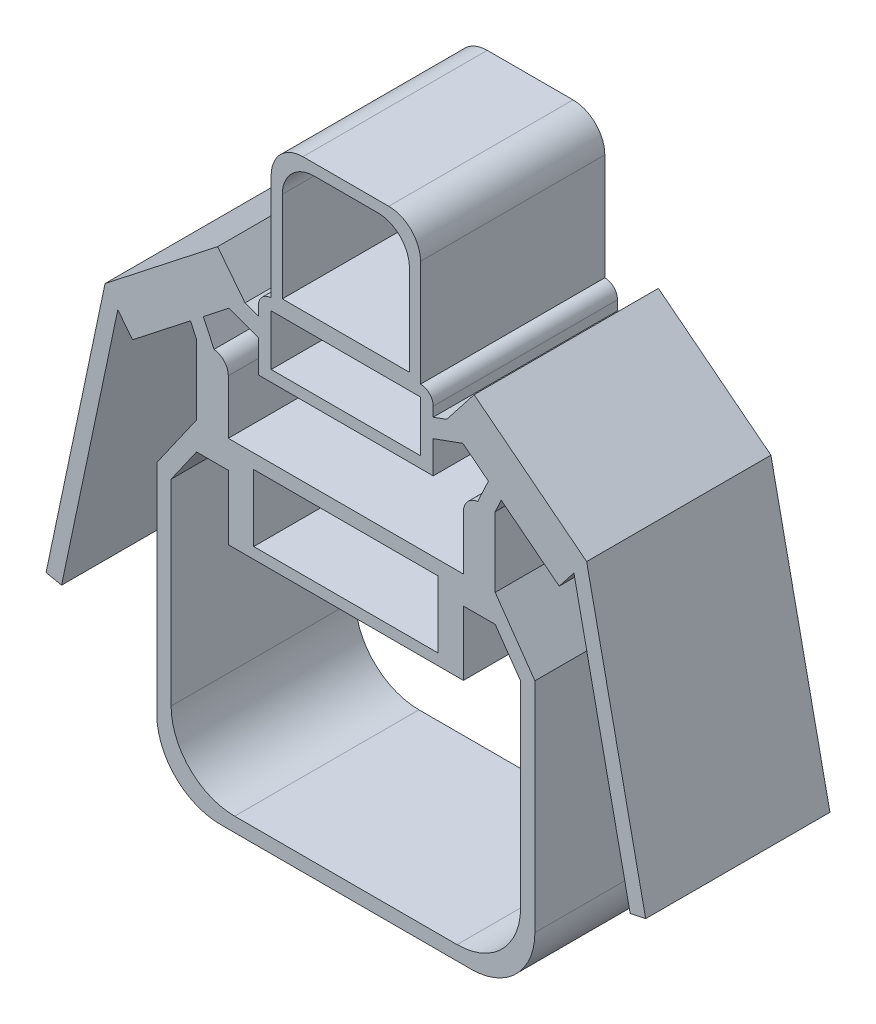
ISO-10303-21;
HEADER;
FILE_DESCRIPTION(('STEP AP214'),'2;1');
FILE_NAME('part.step','',(''),(''),'','','');
FILE_SCHEMA(('AUTOMOTIVE_DESIGN { 1 0 10303 214 1 1 1 1 }'));
ENDSEC;
DATA;
#1=APPLICATION_CONTEXT('core data for automotive mechanical design processes');
#2=APPLICATION_PROTOCOL_DEFINITION('international standard','automotive_design',2000,#1);
#3=PRODUCT_CONTEXT('',#1,'mechanical');
#4=PRODUCT('Part','Part','',(#3));
#5=PRODUCT_RELATED_PRODUCT_CATEGORY('part','',(#4));
#6=PRODUCT_DEFINITION_FORMATION('','',#4);
#7=PRODUCT_DEFINITION_CONTEXT('part definition',#1,'design');
#8=PRODUCT_DEFINITION('design','',#6,#7);
#9=PRODUCT_DEFINITION_SHAPE('','',#8);
#10=(LENGTH_UNIT() NAMED_UNIT(*) SI_UNIT(.MILLI.,.METRE.));
#11=(NAMED_UNIT(*) PLANE_ANGLE_UNIT() SI_UNIT($,.RADIAN.));
#12=(NAMED_UNIT(*) SI_UNIT($,.STERADIAN.) SOLID_ANGLE_UNIT());
#13=UNCERTAINTY_MEASURE_WITH_UNIT(LENGTH_MEASURE(1.E-05),#10,'distance_accuracy_value','');
#14=(GEOMETRIC_REPRESENTATION_CONTEXT(3) GLOBAL_UNCERTAINTY_ASSIGNED_CONTEXT((#13)) GLOBAL_UNIT_ASSIGNED_CONTEXT((#10,
#11,#12)) REPRESENTATION_CONTEXT('',''));
#15=CARTESIAN_POINT('',(0.,0.,0.));
#16=DIRECTION('',(0.,0.,1.));
#17=DIRECTION('',(1.,0.,0.));
#18=AXIS2_PLACEMENT_3D('',#15,#16,#17);
#19=CARTESIAN_POINT('',(3.7,1.4,5.8));
#20=DIRECTION('',(1.,0.,0.));
#21=DIRECTION('',(0.,0.,-1.));
#22=AXIS2_PLACEMENT_3D('',#19,#20,#21);
#23=PLANE('',#22);
#24=DIRECTION('',(0.,-1.,0.));
#25=VECTOR('',#24,1.);
#26=CARTESIAN_POINT('',(3.7,1.4,5.8));
#27=LINE('',#26,#25);
#28=CARTESIAN_POINT('',(3.7,3.10267892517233,5.8));
#29=VERTEX_POINT('',#28);
#30=CARTESIAN_POINT('',(3.7,1.4,5.8));
#31=VERTEX_POINT('',#30);
#32=EDGE_CURVE('E829',#29,#31,#27,.T.);
#33=ORIENTED_EDGE('',*,*,#32,.F.);
#34=DIRECTION('',(0.,0.,1.));
#35=VECTOR('',#34,1.);
#36=CARTESIAN_POINT('',(3.7,3.10267892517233,5.8));
#37=LINE('',#36,#35);
#38=CARTESIAN_POINT('',(3.7,3.10267892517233,0.));
#39=VERTEX_POINT('',#38);
#40=EDGE_CURVE('E979',#29,#39,#37,.F.);
#41=ORIENTED_EDGE('',*,*,#40,.T.);
#42=DIRECTION('',(0.,-1.,0.));
#43=VECTOR('',#42,1.);
#44=CARTESIAN_POINT('',(3.7,1.4,0.));
#45=LINE('',#44,#43);
#46=CARTESIAN_POINT('',(3.7,1.4,0.));
#47=VERTEX_POINT('',#46);
#48=EDGE_CURVE('E828',#39,#47,#45,.T.);
#49=ORIENTED_EDGE('',*,*,#48,.T.);
#50=DIRECTION('',(0.,0.,-1.));
#51=VECTOR('',#50,1.);
#52=CARTESIAN_POINT('',(3.7,1.4,5.8));
#53=LINE('',#52,#51);
#54=EDGE_CURVE('E944',#31,#47,#53,.T.);
#55=ORIENTED_EDGE('',*,*,#54,.F.);
#56=EDGE_LOOP('',(#33,#41,#49,#55));
#57=FACE_BOUND('',#56,.T.);
#58=ADVANCED_FACE('F38',(#57),#23,.F.);
#59=CARTESIAN_POINT('',(-3.7,1.4,5.8));
#60=DIRECTION('',(0.,-1.,0.));
#61=DIRECTION('',(1.,0.,0.));
#62=AXIS2_PLACEMENT_3D('',#59,#60,#61);
#63=PLANE('',#62);
#64=DIRECTION('',(-1.,0.,0.));
#65=VECTOR('',#64,1.);
#66=CARTESIAN_POINT('',(-3.7,1.4,0.));
#67=LINE('',#66,#65);
#68=CARTESIAN_POINT('',(-3.7,1.4,0.));
#69=VERTEX_POINT('',#68);
#70=EDGE_CURVE('E868',#47,#69,#67,.T.);
#71=ORIENTED_EDGE('',*,*,#70,.T.);
#72=DIRECTION('',(0.,0.,-1.));
#73=VECTOR('',#72,1.);
#74=CARTESIAN_POINT('',(-3.7,1.4,5.8));
#75=LINE('',#74,#73);
#76=CARTESIAN_POINT('',(-3.7,1.4,5.8));
#77=VERTEX_POINT('',#76);
#78=EDGE_CURVE('E941',#77,#69,#75,.T.);
#79=ORIENTED_EDGE('',*,*,#78,.F.);
#80=DIRECTION('',(-1.,0.,0.));
#81=VECTOR('',#80,1.);
#82=CARTESIAN_POINT('',(-3.7,1.4,5.8));
#83=LINE('',#82,#81);
#84=EDGE_CURVE('E831',#31,#77,#83,.T.);
#85=ORIENTED_EDGE('',*,*,#84,.F.);
#86=ORIENTED_EDGE('',*,*,#54,.T.);
#87=EDGE_LOOP('',(#71,#79,#85,#86));
#88=FACE_BOUND('',#87,.T.);
#89=ADVANCED_FACE('F1165',(#88),#63,.F.);
#90=CARTESIAN_POINT('',(-3.7,-1.4,5.8));
#91=DIRECTION('',(1.,0.,0.));
#92=DIRECTION('',(0.,0.,-1.));
#93=AXIS2_PLACEMENT_3D('',#90,#91,#92);
#94=PLANE('',#93);
#95=DIRECTION('',(0.,-1.,0.));
#96=VECTOR('',#95,1.);
#97=CARTESIAN_POINT('',(-3.7,-1.4,5.8));
#98=LINE('',#97,#96);
#99=CARTESIAN_POINT('',(-3.7,0.528276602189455,5.8));
#100=VERTEX_POINT('',#99);
#101=CARTESIAN_POINT('',(-3.7,-1.5,5.8));
#102=VERTEX_POINT('',#101);
#103=EDGE_CURVE('E835',#100,#102,#98,.T.);
#104=ORIENTED_EDGE('',*,*,#103,.F.);
#105=DIRECTION('',(0.,0.,1.));
#106=VECTOR('',#105,1.);
#107=CARTESIAN_POINT('',(-3.7,0.528276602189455,0.));
#108=LINE('',#107,#106);
#109=CARTESIAN_POINT('',(-3.7,0.528276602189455,0.));
#110=VERTEX_POINT('',#109);
#111=EDGE_CURVE('E532',#110,#100,#108,.T.);
#112=ORIENTED_EDGE('',*,*,#111,.F.);
#113=DIRECTION('',(0.,-1.,0.));
#114=VECTOR('',#113,1.);
#115=CARTESIAN_POINT('',(-3.7,-1.4,0.));
#116=LINE('',#115,#114);
#117=CARTESIAN_POINT('',(-3.7,-1.5,0.));
#118=VERTEX_POINT('',#117);
#119=EDGE_CURVE('E530',#110,#118,#116,.T.);
#120=ORIENTED_EDGE('',*,*,#119,.T.);
#121=DIRECTION('',(0.,0.,1.));
#122=VECTOR('',#121,1.);
#123=CARTESIAN_POINT('',(-3.7,-1.5,-7.40067564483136));
#124=LINE('',#123,#122);
#125=EDGE_CURVE('E632',#118,#102,#124,.T.);
#126=ORIENTED_EDGE('',*,*,#125,.T.);
#127=EDGE_LOOP('',(#104,#112,#120,#126));
#128=FACE_BOUND('',#127,.T.);
#129=ADVANCED_FACE('F1163',(#128),#94,.F.);
#130=CARTESIAN_POINT('',(3.7,-1.4,5.8));
#131=DIRECTION('',(-1.,0.,0.));
#132=DIRECTION('',(0.,0.,1.));
#133=AXIS2_PLACEMENT_3D('',#130,#131,#132);
#134=PLANE('',#133);
#135=DIRECTION('',(0.,1.,0.));
#136=VECTOR('',#135,1.);
#137=CARTESIAN_POINT('',(3.7,-1.4,0.));
#138=LINE('',#137,#136);
#139=CARTESIAN_POINT('',(3.7,-1.5,0.));
#140=VERTEX_POINT('',#139);
#141=CARTESIAN_POINT('',(3.7,0.528276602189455,0.));
#142=VERTEX_POINT('',#141);
#143=EDGE_CURVE('E872',#140,#142,#138,.T.);
#144=ORIENTED_EDGE('',*,*,#143,.T.);
#145=DIRECTION('',(0.,0.,1.));
#146=VECTOR('',#145,1.);
#147=CARTESIAN_POINT('',(3.7,0.528276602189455,0.));
#148=LINE('',#147,#146);
#149=CARTESIAN_POINT('',(3.7,0.528276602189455,5.8));
#150=VERTEX_POINT('',#149);
#151=EDGE_CURVE('E1118',#142,#150,#148,.T.);
#152=ORIENTED_EDGE('',*,*,#151,.T.);
#153=DIRECTION('',(0.,1.,0.));
#154=VECTOR('',#153,1.);
#155=CARTESIAN_POINT('',(3.7,-1.4,5.8));
#156=LINE('',#155,#154);
#157=CARTESIAN_POINT('',(3.7,-1.5,5.8));
#158=VERTEX_POINT('',#157);
#159=EDGE_CURVE('E837',#158,#150,#156,.T.);
#160=ORIENTED_EDGE('',*,*,#159,.F.);
#161=DIRECTION('',(0.,0.,1.));
#162=VECTOR('',#161,1.);
#163=CARTESIAN_POINT('',(3.7,-1.5,-7.40067564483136));
#164=LINE('',#163,#162);
#165=EDGE_CURVE('E629',#140,#158,#164,.T.);
#166=ORIENTED_EDGE('',*,*,#165,.F.);
#167=EDGE_LOOP('',(#144,#152,#160,#166));
#168=FACE_BOUND('',#167,.T.);
#169=ADVANCED_FACE('F1159',(#168),#134,.F.);
#170=CARTESIAN_POINT('',(4.7,3.6,5.8));
#171=DIRECTION('',(-1.,0.,0.));
#172=DIRECTION('',(0.,-1.,0.));
#173=AXIS2_PLACEMENT_3D('',#170,#171,#172);
#174=PLANE('',#173);
#175=DIRECTION('',(0.,1.,0.));
#176=VECTOR('',#175,1.);
#177=CARTESIAN_POINT('',(4.7,3.6,5.8));
#178=LINE('',#177,#176);
#179=CARTESIAN_POINT('',(4.7,1.4,5.8));
#180=VERTEX_POINT('',#179);
#181=CARTESIAN_POINT('',(4.7,3.6,5.8));
#182=VERTEX_POINT('',#181);
#183=EDGE_CURVE('E839',#180,#182,#178,.T.);
#184=ORIENTED_EDGE('',*,*,#183,.F.);
#185=DIRECTION('',(0.,0.,1.));
#186=VECTOR('',#185,1.);
#187=CARTESIAN_POINT('',(4.7,1.4,-15.9697370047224));
#188=LINE('',#187,#186);
#189=CARTESIAN_POINT('',(4.7,1.4,0.));
#190=VERTEX_POINT('',#189);
#191=EDGE_CURVE('E552',#190,#180,#188,.T.);
#192=ORIENTED_EDGE('',*,*,#191,.F.);
#193=DIRECTION('',(0.,1.,0.));
#194=VECTOR('',#193,1.);
#195=CARTESIAN_POINT('',(4.7,3.6,0.));
#196=LINE('',#195,#194);
#197=CARTESIAN_POINT('',(4.7,3.6,0.));
#198=VERTEX_POINT('',#197);
#199=EDGE_CURVE('E874',#190,#198,#196,.T.);
#200=ORIENTED_EDGE('',*,*,#199,.T.);
#201=DIRECTION('',(0.,0.,-1.));
#202=VECTOR('',#201,1.);
#203=CARTESIAN_POINT('',(4.7,3.6,5.8));
#204=LINE('',#203,#202);
#205=EDGE_CURVE('E938',#182,#198,#204,.T.);
#206=ORIENTED_EDGE('',*,*,#205,.F.);
#207=EDGE_LOOP('',(#184,#192,#200,#206));
#208=FACE_BOUND('',#207,.T.);
#209=ADVANCED_FACE('F1171',(#208),#174,.F.);
#210=CARTESIAN_POINT('',(4.7,3.6,5.8));
#211=DIRECTION('',(-0.906307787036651,0.422618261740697,0.));
#212=DIRECTION('',(-0.422618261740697,-0.906307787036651,0.));
#213=AXIS2_PLACEMENT_3D('',#210,#211,#212);
#214=PLANE('',#213);
#215=DIRECTION('',(0.422618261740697,0.906307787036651,0.));
#216=VECTOR('',#215,1.);
#217=CARTESIAN_POINT('',(4.7,3.6,0.));
#218=LINE('',#217,#216);
#219=CARTESIAN_POINT('',(4.89017821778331,4.00783850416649,0.));
#220=VERTEX_POINT('',#219);
#221=EDGE_CURVE('E876',#198,#220,#218,.T.);
#222=ORIENTED_EDGE('',*,*,#221,.T.);
#223=DIRECTION('',(0.,0.,-1.));
#224=VECTOR('',#223,1.);
#225=CARTESIAN_POINT('',(4.89017821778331,4.00783850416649,5.8));
#226=LINE('',#225,#224);
#227=CARTESIAN_POINT('',(4.89017821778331,4.00783850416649,5.8));
#228=VERTEX_POINT('',#227);
#229=EDGE_CURVE('E935',#228,#220,#226,.T.);
#230=ORIENTED_EDGE('',*,*,#229,.F.);
#231=DIRECTION('',(0.422618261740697,0.906307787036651,0.));
#232=VECTOR('',#231,1.);
#233=CARTESIAN_POINT('',(4.7,3.6,5.8));
#234=LINE('',#233,#232);
#235=EDGE_CURVE('E841',#182,#228,#234,.T.);
#236=ORIENTED_EDGE('',*,*,#235,.F.);
#237=ORIENTED_EDGE('',*,*,#205,.T.);
#238=EDGE_LOOP('',(#222,#230,#236,#237));
#239=FACE_BOUND('',#238,.T.);
#240=ADVANCED_FACE('F1561',(#239),#214,.F.);
#241=CARTESIAN_POINT('',(4.89017821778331,4.00783850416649,5.8));
#242=DIRECTION('',(0.616900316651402,0.787041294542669,0.));
#243=DIRECTION('',(-0.787041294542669,0.616900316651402,0.));
#244=AXIS2_PLACEMENT_3D('',#241,#242,#243);
#245=PLANE('',#244);
#246=DIRECTION('',(0.787041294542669,-0.616900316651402,0.));
#247=VECTOR('',#246,1.);
#248=CARTESIAN_POINT('',(4.89017821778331,4.00783850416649,0.));
#249=LINE('',#248,#247);
#250=CARTESIAN_POINT('',(6.71454750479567,2.57785763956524,0.));
#251=VERTEX_POINT('',#250);
#252=EDGE_CURVE('E878',#220,#251,#249,.T.);
#253=ORIENTED_EDGE('',*,*,#252,.T.);
#254=DIRECTION('',(0.,0.,-1.));
#255=VECTOR('',#254,1.);
#256=CARTESIAN_POINT('',(6.71454750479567,2.57785763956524,5.8));
#257=LINE('',#256,#255);
#258=CARTESIAN_POINT('',(6.71454750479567,2.57785763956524,5.8));
#259=VERTEX_POINT('',#258);
#260=EDGE_CURVE('E932',#259,#251,#257,.T.);
#261=ORIENTED_EDGE('',*,*,#260,.F.);
#262=DIRECTION('',(0.787041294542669,-0.616900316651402,0.));
#263=VECTOR('',#262,1.);
#264=CARTESIAN_POINT('',(4.89017821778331,4.00783850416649,5.8));
#265=LINE('',#264,#263);
#266=EDGE_CURVE('E843',#228,#259,#265,.T.);
#267=ORIENTED_EDGE('',*,*,#266,.F.);
#268=ORIENTED_EDGE('',*,*,#229,.T.);
#269=EDGE_LOOP('',(#253,#261,#267,#268));
#270=FACE_BOUND('',#269,.T.);
#271=ADVANCED_FACE('F1726',(#270),#245,.F.);
#272=CARTESIAN_POINT('',(6.71454750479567,2.57785763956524,5.8));
#273=DIRECTION('',(-0.787041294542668,0.616900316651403,0.));
#274=DIRECTION('',(-0.616900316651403,-0.787041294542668,0.));
#275=AXIS2_PLACEMENT_3D('',#272,#273,#274);
#276=PLANE('',#275);
#277=DIRECTION('',(0.616900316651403,0.787041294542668,0.));
#278=VECTOR('',#277,1.);
#279=CARTESIAN_POINT('',(6.71454750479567,2.57785763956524,0.));
#280=LINE('',#279,#278);
#281=CARTESIAN_POINT('',(7.17722274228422,3.16813861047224,0.));
#282=VERTEX_POINT('',#281);
#283=EDGE_CURVE('E880',#251,#282,#280,.T.);
#284=ORIENTED_EDGE('',*,*,#283,.T.);
#285=DIRECTION('',(0.,0.,1.));
#286=VECTOR('',#285,1.);
#287=CARTESIAN_POINT('',(7.17722274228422,3.16813861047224,-9.19079627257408));
#288=LINE('',#287,#286);
#289=CARTESIAN_POINT('',(7.17722274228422,3.16813861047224,5.8));
#290=VERTEX_POINT('',#289);
#291=EDGE_CURVE('E663',#282,#290,#288,.T.);
#292=ORIENTED_EDGE('',*,*,#291,.T.);
#293=DIRECTION('',(0.616900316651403,0.787041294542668,0.));
#294=VECTOR('',#293,1.);
#295=CARTESIAN_POINT('',(6.71454750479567,2.57785763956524,5.8));
#296=LINE('',#295,#294);
#297=EDGE_CURVE('E845',#259,#290,#296,.T.);
#298=ORIENTED_EDGE('',*,*,#297,.F.);
#299=ORIENTED_EDGE('',*,*,#260,.T.);
#300=EDGE_LOOP('',(#284,#292,#298,#299));
#301=FACE_BOUND('',#300,.T.);
#302=ADVANCED_FACE('F1714',(#301),#276,.F.);
#303=CARTESIAN_POINT('',(4.03652212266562,6.45576687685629,5.8));
#304=DIRECTION('',(-0.616900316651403,-0.787041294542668,0.));
#305=DIRECTION('',(0.787041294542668,-0.616900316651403,0.));
#306=AXIS2_PLACEMENT_3D('',#303,#304,#305);
#307=PLANE('',#306);
#308=DIRECTION('',(-0.787041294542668,0.616900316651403,0.));
#309=VECTOR('',#308,1.);
#310=CARTESIAN_POINT('',(4.03652212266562,6.45576687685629,0.));
#311=LINE('',#310,#309);
#312=CARTESIAN_POINT('',(7.57820794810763,3.67971545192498,0.));
#313=VERTEX_POINT('',#312);
#314=CARTESIAN_POINT('',(4.03652212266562,6.45576687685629,0.));
#315=VERTEX_POINT('',#314);
#316=EDGE_CURVE('E882',#313,#315,#311,.T.);
#317=ORIENTED_EDGE('',*,*,#316,.T.);
#318=DIRECTION('',(0.,0.,-1.));
#319=VECTOR('',#318,1.);
#320=CARTESIAN_POINT('',(4.03652212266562,6.45576687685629,5.8));
#321=LINE('',#320,#319);
#322=CARTESIAN_POINT('',(4.03652212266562,6.45576687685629,5.8));
#323=VERTEX_POINT('',#322);
#324=EDGE_CURVE('E926',#323,#315,#321,.T.);
#325=ORIENTED_EDGE('',*,*,#324,.F.);
#326=DIRECTION('',(-0.787041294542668,0.616900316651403,0.));
#327=VECTOR('',#326,1.);
#328=CARTESIAN_POINT('',(4.03652212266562,6.45576687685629,5.8));
#329=LINE('',#328,#327);
#330=CARTESIAN_POINT('',(7.57820794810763,3.67971545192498,5.8));
#331=VERTEX_POINT('',#330);
#332=EDGE_CURVE('E848',#331,#323,#329,.T.);
#333=ORIENTED_EDGE('',*,*,#332,.F.);
#334=DIRECTION('',(0.,0.,-1.));
#335=VECTOR('',#334,1.);
#336=CARTESIAN_POINT('',(7.57820794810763,3.67971545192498,5.8));
#337=LINE('',#336,#335);
#338=EDGE_CURVE('E929',#331,#313,#337,.T.);
#339=ORIENTED_EDGE('',*,*,#338,.T.);
#340=EDGE_LOOP('',(#317,#325,#333,#339));
#341=FACE_BOUND('',#340,.T.);
#342=ADVANCED_FACE('F1708',(#341),#307,.F.);
#343=CARTESIAN_POINT('',(4.03652212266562,6.45576687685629,5.8));
#344=DIRECTION('',(0.787041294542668,-0.616900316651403,0.));
#345=DIRECTION('',(0.616900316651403,0.787041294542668,0.));
#346=AXIS2_PLACEMENT_3D('',#343,#344,#345);
#347=PLANE('',#346);
#348=DIRECTION('',(-0.616900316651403,-0.787041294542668,0.));
#349=VECTOR('',#348,1.);
#350=CARTESIAN_POINT('',(4.03652212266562,6.45576687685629,0.));
#351=LINE('',#350,#349);
#352=CARTESIAN_POINT('',(3.17286167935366,5.35390906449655,0.));
#353=VERTEX_POINT('',#352);
#354=EDGE_CURVE('E884',#315,#353,#351,.T.);
#355=ORIENTED_EDGE('',*,*,#354,.T.);
#356=DIRECTION('',(0.,0.,-1.));
#357=VECTOR('',#356,1.);
#358=CARTESIAN_POINT('',(3.17286167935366,5.35390906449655,5.8));
#359=LINE('',#358,#357);
#360=CARTESIAN_POINT('',(3.17286167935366,5.35390906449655,5.8));
#361=VERTEX_POINT('',#360);
#362=EDGE_CURVE('E923',#361,#353,#359,.T.);
#363=ORIENTED_EDGE('',*,*,#362,.F.);
#364=DIRECTION('',(-0.616900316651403,-0.787041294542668,0.));
#365=VECTOR('',#364,1.);
#366=CARTESIAN_POINT('',(4.03652212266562,6.45576687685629,5.8));
#367=LINE('',#366,#365);
#368=EDGE_CURVE('E850',#323,#361,#367,.T.);
#369=ORIENTED_EDGE('',*,*,#368,.F.);
#370=ORIENTED_EDGE('',*,*,#324,.T.);
#371=EDGE_LOOP('',(#355,#363,#369,#370));
#372=FACE_BOUND('',#371,.T.);
#373=ADVANCED_FACE('F1713',(#372),#347,.F.);
#374=CARTESIAN_POINT('',(2.75,5.2,5.8));
#375=DIRECTION('',(0.342020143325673,-0.939692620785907,0.));
#376=DIRECTION('',(0.939692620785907,0.342020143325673,0.));
#377=AXIS2_PLACEMENT_3D('',#374,#375,#376);
#378=PLANE('',#377);
#379=DIRECTION('',(-0.939692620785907,-0.342020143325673,0.));
#380=VECTOR('',#379,1.);
#381=CARTESIAN_POINT('',(2.75,5.2,0.));
#382=LINE('',#381,#380);
#383=CARTESIAN_POINT('',(2.75,5.2,0.));
#384=VERTEX_POINT('',#383);
#385=EDGE_CURVE('E886',#353,#384,#382,.T.);
#386=ORIENTED_EDGE('',*,*,#385,.T.);
#387=DIRECTION('',(0.,0.,-1.));
#388=VECTOR('',#387,1.);
#389=CARTESIAN_POINT('',(2.75,5.2,5.8));
#390=LINE('',#389,#388);
#391=CARTESIAN_POINT('',(2.75,5.2,5.8));
#392=VERTEX_POINT('',#391);
#393=EDGE_CURVE('E920',#392,#384,#390,.T.);
#394=ORIENTED_EDGE('',*,*,#393,.F.);
#395=DIRECTION('',(-0.939692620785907,-0.342020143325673,0.));
#396=VECTOR('',#395,1.);
#397=CARTESIAN_POINT('',(2.75,5.2,5.8));
#398=LINE('',#397,#396);
#399=EDGE_CURVE('E852',#361,#392,#398,.T.);
#400=ORIENTED_EDGE('',*,*,#399,.F.);
#401=ORIENTED_EDGE('',*,*,#362,.T.);
#402=EDGE_LOOP('',(#386,#394,#400,#401));
#403=FACE_BOUND('',#402,.T.);
#404=ADVANCED_FACE('F1792',(#403),#378,.F.);
#405=CARTESIAN_POINT('',(-2.75,5.2,5.8));
#406=DIRECTION('',(1.,0.,0.));
#407=DIRECTION('',(0.,0.,-1.));
#408=AXIS2_PLACEMENT_3D('',#405,#406,#407);
#409=PLANE('',#408);
#410=DIRECTION('',(0.,-1.,0.));
#411=VECTOR('',#410,1.);
#412=CARTESIAN_POINT('',(-2.75,5.2,5.8));
#413=LINE('',#412,#411);
#414=CARTESIAN_POINT('',(-2.75,4.61470222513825,5.8));
#415=VERTEX_POINT('',#414);
#416=CARTESIAN_POINT('',(-2.75,3.6,5.8));
#417=VERTEX_POINT('',#416);
#418=EDGE_CURVE('E854',#415,#417,#413,.T.);
#419=ORIENTED_EDGE('',*,*,#418,.F.);
#420=DIRECTION('',(0.,0.,-1.));
#421=VECTOR('',#420,1.);
#422=CARTESIAN_POINT('',(-2.75,4.61470222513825,5.8));
#423=LINE('',#422,#421);
#424=CARTESIAN_POINT('',(-2.75,4.61470222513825,0.));
#425=VERTEX_POINT('',#424);
#426=EDGE_CURVE('E818',#415,#425,#423,.T.);
#427=ORIENTED_EDGE('',*,*,#426,.T.);
#428=DIRECTION('',(0.,-1.,0.));
#429=VECTOR('',#428,1.);
#430=CARTESIAN_POINT('',(-2.75,5.2,0.));
#431=LINE('',#430,#429);
#432=CARTESIAN_POINT('',(-2.75,3.6,0.));
#433=VERTEX_POINT('',#432);
#434=EDGE_CURVE('E888',#425,#433,#431,.T.);
#435=ORIENTED_EDGE('',*,*,#434,.T.);
#436=DIRECTION('',(0.,0.,-1.));
#437=VECTOR('',#436,1.);
#438=CARTESIAN_POINT('',(-2.75,3.6,5.8));
#439=LINE('',#438,#437);
#440=EDGE_CURVE('E914',#417,#433,#439,.T.);
#441=ORIENTED_EDGE('',*,*,#440,.F.);
#442=EDGE_LOOP('',(#419,#427,#435,#441));
#443=FACE_BOUND('',#442,.T.);
#444=ADVANCED_FACE('F1797',(#443),#409,.F.);
#445=CARTESIAN_POINT('',(-2.75,3.6,5.8));
#446=DIRECTION('',(0.,1.,0.));
#447=DIRECTION('',(0.,0.,1.));
#448=AXIS2_PLACEMENT_3D('',#445,#446,#447);
#449=PLANE('',#448);
#450=DIRECTION('',(1.,0.,0.));
#451=VECTOR('',#450,1.);
#452=CARTESIAN_POINT('',(-2.75,3.6,0.));
#453=LINE('',#452,#451);
#454=CARTESIAN_POINT('',(2.75,3.6,0.));
#455=VERTEX_POINT('',#454);
#456=EDGE_CURVE('E890',#433,#455,#453,.T.);
#457=ORIENTED_EDGE('',*,*,#456,.T.);
#458=DIRECTION('',(0.,0.,-1.));
#459=VECTOR('',#458,1.);
#460=CARTESIAN_POINT('',(2.75,3.6,5.8));
#461=LINE('',#460,#459);
#462=CARTESIAN_POINT('',(2.75,3.6,5.8));
#463=VERTEX_POINT('',#462);
#464=EDGE_CURVE('E911',#463,#455,#461,.T.);
#465=ORIENTED_EDGE('',*,*,#464,.F.);
#466=DIRECTION('',(1.,0.,0.));
#467=VECTOR('',#466,1.);
#468=CARTESIAN_POINT('',(-2.75,3.6,5.8));
#469=LINE('',#468,#467);
#470=EDGE_CURVE('E856',#417,#463,#469,.T.);
#471=ORIENTED_EDGE('',*,*,#470,.F.);
#472=ORIENTED_EDGE('',*,*,#440,.T.);
#473=EDGE_LOOP('',(#457,#465,#471,#472));
#474=FACE_BOUND('',#473,.T.);
#475=ADVANCED_FACE('F1850',(#474),#449,.F.);
#476=CARTESIAN_POINT('',(2.75,4.61470222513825,5.8));
#477=DIRECTION('',(-1.,0.,0.));
#478=DIRECTION('',(0.,-1.,0.));
#479=AXIS2_PLACEMENT_3D('',#476,#477,#478);
#480=PLANE('',#479);
#481=DIRECTION('',(0.,1.,0.));
#482=VECTOR('',#481,1.);
#483=CARTESIAN_POINT('',(2.75,4.61470222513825,0.));
#484=LINE('',#483,#482);
#485=CARTESIAN_POINT('',(2.75,4.61470222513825,0.));
#486=VERTEX_POINT('',#485);
#487=EDGE_CURVE('E892',#455,#486,#484,.T.);
#488=ORIENTED_EDGE('',*,*,#487,.T.);
#489=DIRECTION('',(0.,0.,-1.));
#490=VECTOR('',#489,1.);
#491=CARTESIAN_POINT('',(2.75,4.61470222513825,5.8));
#492=LINE('',#491,#490);
#493=CARTESIAN_POINT('',(2.75,4.61470222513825,5.8));
#494=VERTEX_POINT('',#493);
#495=EDGE_CURVE('E908',#494,#486,#492,.T.);
#496=ORIENTED_EDGE('',*,*,#495,.F.);
#497=DIRECTION('',(0.,1.,0.));
#498=VECTOR('',#497,1.);
#499=CARTESIAN_POINT('',(2.75,4.61470222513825,5.8));
#500=LINE('',#499,#498);
#501=EDGE_CURVE('E858',#463,#494,#500,.T.);
#502=ORIENTED_EDGE('',*,*,#501,.F.);
#503=ORIENTED_EDGE('',*,*,#464,.T.);
#504=EDGE_LOOP('',(#488,#496,#502,#503));
#505=FACE_BOUND('',#504,.T.);
#506=ADVANCED_FACE('F1876',(#505),#480,.F.);
#507=CARTESIAN_POINT('',(2.75,4.61470222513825,5.8));
#508=DIRECTION('',(-0.342020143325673,0.939692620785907,0.));
#509=DIRECTION('',(-0.939692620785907,-0.342020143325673,0.));
#510=AXIS2_PLACEMENT_3D('',#507,#508,#509);
#511=PLANE('',#510);
#512=DIRECTION('',(0.939692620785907,0.342020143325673,0.));
#513=VECTOR('',#512,1.);
#514=CARTESIAN_POINT('',(2.75,4.61470222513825,0.));
#515=LINE('',#514,#513);
#516=CARTESIAN_POINT('',(3.6827952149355,4.95421191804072,0.));
#517=VERTEX_POINT('',#516);
#518=EDGE_CURVE('E894',#486,#517,#515,.T.);
#519=ORIENTED_EDGE('',*,*,#518,.T.);
#520=DIRECTION('',(0.,0.,-1.));
#521=VECTOR('',#520,1.);
#522=CARTESIAN_POINT('',(3.6827952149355,4.95421191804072,5.8));
#523=LINE('',#522,#521);
#524=CARTESIAN_POINT('',(3.6827952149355,4.95421191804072,5.8));
#525=VERTEX_POINT('',#524);
#526=EDGE_CURVE('E905',#525,#517,#523,.T.);
#527=ORIENTED_EDGE('',*,*,#526,.F.);
#528=DIRECTION('',(0.939692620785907,0.342020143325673,0.));
#529=VECTOR('',#528,1.);
#530=CARTESIAN_POINT('',(2.75,4.61470222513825,5.8));
#531=LINE('',#530,#529);
#532=EDGE_CURVE('E860',#494,#525,#531,.T.);
#533=ORIENTED_EDGE('',*,*,#532,.F.);
#534=ORIENTED_EDGE('',*,*,#495,.T.);
#535=EDGE_LOOP('',(#519,#527,#533,#534));
#536=FACE_BOUND('',#535,.T.);
#537=ADVANCED_FACE('F1866',(#536),#511,.F.);
#538=CARTESIAN_POINT('',(3.6827952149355,4.95421191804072,5.8));
#539=DIRECTION('',(0.616900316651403,0.787041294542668,0.));
#540=DIRECTION('',(-0.787041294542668,0.616900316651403,0.));
#541=AXIS2_PLACEMENT_3D('',#538,#539,#540);
#542=PLANE('',#541);
#543=DIRECTION('',(0.787041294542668,-0.616900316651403,0.));
#544=VECTOR('',#543,1.);
#545=CARTESIAN_POINT('',(3.6827952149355,4.95421191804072,0.));
#546=LINE('',#545,#544);
#547=CARTESIAN_POINT('',(4.48615913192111,4.32451757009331,0.));
#548=VERTEX_POINT('',#547);
#549=EDGE_CURVE('E896',#517,#548,#546,.T.);
#550=ORIENTED_EDGE('',*,*,#549,.T.);
#551=DIRECTION('',(0.,0.,-1.));
#552=VECTOR('',#551,1.);
#553=CARTESIAN_POINT('',(4.48615913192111,4.32451757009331,5.8));
#554=LINE('',#553,#552);
#555=CARTESIAN_POINT('',(4.48615913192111,4.32451757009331,5.8));
#556=VERTEX_POINT('',#555);
#557=EDGE_CURVE('E902',#556,#548,#554,.T.);
#558=ORIENTED_EDGE('',*,*,#557,.F.);
#559=DIRECTION('',(0.787041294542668,-0.616900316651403,0.));
#560=VECTOR('',#559,1.);
#561=CARTESIAN_POINT('',(3.6827952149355,4.95421191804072,5.8));
#562=LINE('',#561,#560);
#563=EDGE_CURVE('E862',#525,#556,#562,.T.);
#564=ORIENTED_EDGE('',*,*,#563,.F.);
#565=ORIENTED_EDGE('',*,*,#526,.T.);
#566=EDGE_LOOP('',(#550,#558,#564,#565));
#567=FACE_BOUND('',#566,.T.);
#568=ADVANCED_FACE('F1452',(#567),#542,.F.);
#569=CARTESIAN_POINT('',(4.14831104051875,3.6,5.8));
#570=DIRECTION('',(0.906307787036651,-0.422618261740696,0.));
#571=DIRECTION('',(0.422618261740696,0.906307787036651,0.));
#572=AXIS2_PLACEMENT_3D('',#569,#570,#571);
#573=PLANE('',#572);
#574=DIRECTION('',(-0.422618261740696,-0.906307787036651,0.));
#575=VECTOR('',#574,1.);
#576=CARTESIAN_POINT('',(4.14831104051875,3.6,0.));
#577=LINE('',#576,#575);
#578=CARTESIAN_POINT('',(4.14831104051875,3.6,0.));
#579=VERTEX_POINT('',#578);
#580=EDGE_CURVE('E832',#548,#579,#577,.T.);
#581=ORIENTED_EDGE('',*,*,#580,.T.);
#582=DIRECTION('',(0.,0.,-1.));
#583=VECTOR('',#582,1.);
#584=CARTESIAN_POINT('',(4.14831104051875,3.6,5.8));
#585=LINE('',#584,#583);
#586=CARTESIAN_POINT('',(4.14831104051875,3.6,5.8));
#587=VERTEX_POINT('',#586);
#588=EDGE_CURVE('E866',#587,#579,#585,.T.);
#589=ORIENTED_EDGE('',*,*,#588,.F.);
#590=DIRECTION('',(-0.422618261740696,-0.906307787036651,0.));
#591=VECTOR('',#590,1.);
#592=CARTESIAN_POINT('',(4.14831104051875,3.6,5.8));
#593=LINE('',#592,#591);
#594=EDGE_CURVE('E864',#556,#587,#593,.T.);
#595=ORIENTED_EDGE('',*,*,#594,.F.);
#596=ORIENTED_EDGE('',*,*,#557,.T.);
#597=EDGE_LOOP('',(#581,#589,#595,#596));
#598=FACE_BOUND('',#597,.T.);
#599=ADVANCED_FACE('F1320',(#598),#573,.F.);
#600=CARTESIAN_POINT('',(0.,0.,5.8));
#601=DIRECTION('',(0.,0.,-1.));
#602=DIRECTION('',(-1.,0.,0.));
#603=AXIS2_PLACEMENT_3D('',#600,#601,#602);
#604=PLANE('',#603);
#605=DIRECTION('',(0.573576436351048,0.819152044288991,0.));
#606=VECTOR('',#605,1.);
#607=CARTESIAN_POINT('',(-5.5,-0.614241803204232,5.8));
#608=LINE('',#607,#606);
#609=CARTESIAN_POINT('',(-5.5,-0.614241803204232,5.8));
#610=VERTEX_POINT('',#609);
#611=CARTESIAN_POINT('',(-4.7,0.528276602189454,5.8));
#612=VERTEX_POINT('',#611);
#613=EDGE_CURVE('E1086',#610,#612,#608,.T.);
#614=ORIENTED_EDGE('',*,*,#613,.T.);
#615=DIRECTION('',(-1.,0.,0.));
#616=VECTOR('',#615,1.);
#617=CARTESIAN_POINT('',(-3.7,0.528276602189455,5.8));
#618=LINE('',#617,#616);
#619=EDGE_CURVE('E516',#100,#612,#618,.T.);
#620=ORIENTED_EDGE('',*,*,#619,.F.);
#621=ORIENTED_EDGE('',*,*,#103,.T.);
#622=DIRECTION('',(1.,0.,0.));
#623=VECTOR('',#622,1.);
#624=CARTESIAN_POINT('',(-3.7,-1.5,5.8));
#625=LINE('',#624,#623);
#626=EDGE_CURVE('E621',#102,#158,#625,.T.);
#627=ORIENTED_EDGE('',*,*,#626,.T.);
#628=ORIENTED_EDGE('',*,*,#159,.T.);
#629=DIRECTION('',(-1.,0.,0.));
#630=VECTOR('',#629,1.);
#631=CARTESIAN_POINT('',(4.7,0.528276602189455,5.8));
#632=LINE('',#631,#630);
#633=CARTESIAN_POINT('',(4.7,0.528276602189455,5.8));
#634=VERTEX_POINT('',#633);
#635=EDGE_CURVE('E1122',#634,#150,#632,.T.);
#636=ORIENTED_EDGE('',*,*,#635,.F.);
#637=DIRECTION('',(0.573576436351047,-0.819152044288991,0.));
#638=VECTOR('',#637,1.);
#639=CARTESIAN_POINT('',(5.5,-0.614241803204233,5.8));
#640=LINE('',#639,#638);
#641=CARTESIAN_POINT('',(5.5,-0.614241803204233,5.8));
#642=VERTEX_POINT('',#641);
#643=EDGE_CURVE('E1095',#634,#642,#640,.T.);
#644=ORIENTED_EDGE('',*,*,#643,.T.);
#645=DIRECTION('',(0.,-1.,0.));
#646=VECTOR('',#645,1.);
#647=CARTESIAN_POINT('',(5.5,-0.614241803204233,5.8));
#648=LINE('',#647,#646);
#649=CARTESIAN_POINT('',(5.5,-6.8,5.8));
#650=VERTEX_POINT('',#649);
#651=EDGE_CURVE('E1092',#642,#650,#648,.T.);
#652=ORIENTED_EDGE('',*,*,#651,.T.);
#653=CARTESIAN_POINT('',(3.5,-6.8,5.8));
#654=DIRECTION('',(0.,0.,-1.));
#655=DIRECTION('',(-1.,0.,0.));
#656=AXIS2_PLACEMENT_3D('',#653,#654,#655);
#657=CIRCLE('',#656,2.);
#658=CARTESIAN_POINT('',(3.5,-8.8,5.8));
#659=VERTEX_POINT('',#658);
#660=EDGE_CURVE('E1037',#650,#659,#657,.T.);
#661=ORIENTED_EDGE('',*,*,#660,.T.);
#662=DIRECTION('',(-1.,0.,0.));
#663=VECTOR('',#662,1.);
#664=CARTESIAN_POINT('',(5.5,-8.8,5.8));
#665=LINE('',#664,#663);
#666=CARTESIAN_POINT('',(-3.5,-8.8,5.8));
#667=VERTEX_POINT('',#666);
#668=EDGE_CURVE('E1090',#659,#667,#665,.T.);
#669=ORIENTED_EDGE('',*,*,#668,.T.);
#670=CARTESIAN_POINT('',(-3.5,-6.8,5.8));
#671=DIRECTION('',(0.,0.,-1.));
#672=DIRECTION('',(-1.,0.,0.));
#673=AXIS2_PLACEMENT_3D('',#670,#671,#672);
#674=CIRCLE('',#673,2.);
#675=CARTESIAN_POINT('',(-5.5,-6.8,5.8));
#676=VERTEX_POINT('',#675);
#677=EDGE_CURVE('E53',#667,#676,#674,.T.);
#678=ORIENTED_EDGE('',*,*,#677,.T.);
#679=DIRECTION('',(0.,1.,0.));
#680=VECTOR('',#679,1.);
#681=CARTESIAN_POINT('',(-5.5,-8.8,5.8));
#682=LINE('',#681,#680);
#683=EDGE_CURVE('E1088',#676,#610,#682,.T.);
#684=ORIENTED_EDGE('',*,*,#683,.T.);
#685=EDGE_LOOP('',(#614,#620,#621,#627,#628,#636,#644,#652,#661,#669,#678,#684));
#686=FACE_BOUND('',#685,.T.);
#687=DIRECTION('',(1.,0.,0.));
#688=VECTOR('',#687,1.);
#689=CARTESIAN_POINT('',(-2.9,-1.15,5.8));
#690=LINE('',#689,#688);
#691=CARTESIAN_POINT('',(-2.9,-1.15,5.8));
#692=VERTEX_POINT('',#691);
#693=CARTESIAN_POINT('',(2.9,-1.15,5.8));
#694=VERTEX_POINT('',#693);
#695=EDGE_CURVE('E601',#692,#694,#690,.T.);
#696=ORIENTED_EDGE('',*,*,#695,.F.);
#697=DIRECTION('',(0.,-1.,0.));
#698=VECTOR('',#697,1.);
#699=CARTESIAN_POINT('',(-2.9,-1.05,5.8));
#700=LINE('',#699,#698);
#701=CARTESIAN_POINT('',(-2.9,0.95,5.8));
#702=VERTEX_POINT('',#701);
#703=EDGE_CURVE('E722',#702,#692,#700,.T.);
#704=ORIENTED_EDGE('',*,*,#703,.F.);
#705=DIRECTION('',(1.,0.,0.));
#706=VECTOR('',#705,1.);
#707=CARTESIAN_POINT('',(-2.9,0.95,5.8));
#708=LINE('',#707,#706);
#709=CARTESIAN_POINT('',(2.9,0.95,5.8));
#710=VERTEX_POINT('',#709);
#711=EDGE_CURVE('E635',#702,#710,#708,.T.);
#712=ORIENTED_EDGE('',*,*,#711,.T.);
#713=DIRECTION('',(0.,1.,0.));
#714=VECTOR('',#713,1.);
#715=CARTESIAN_POINT('',(2.9,-1.05,5.8));
#716=LINE('',#715,#714);
#717=EDGE_CURVE('E725',#694,#710,#716,.T.);
#718=ORIENTED_EDGE('',*,*,#717,.F.);
#719=EDGE_LOOP('',(#696,#704,#712,#718));
#720=FACE_BOUND('',#719,.T.);
#721=DIRECTION('',(1.,0.,0.));
#722=VECTOR('',#721,1.);
#723=CARTESIAN_POINT('',(2.35,5.55,5.8));
#724=LINE('',#723,#722);
#725=CARTESIAN_POINT('',(-2.35,5.55,5.8));
#726=VERTEX_POINT('',#725);
#727=CARTESIAN_POINT('',(2.35,5.55,5.8));
#728=VERTEX_POINT('',#727);
#729=EDGE_CURVE('E693',#726,#728,#724,.T.);
#730=ORIENTED_EDGE('',*,*,#729,.T.);
#731=DIRECTION('',(0.,1.,0.));
#732=VECTOR('',#731,1.);
#733=CARTESIAN_POINT('',(2.35,5.55,5.8));
#734=LINE('',#733,#732);
#735=CARTESIAN_POINT('',(2.35,3.95,5.8));
#736=VERTEX_POINT('',#735);
#737=EDGE_CURVE('E733',#736,#728,#734,.T.);
#738=ORIENTED_EDGE('',*,*,#737,.F.);
#739=DIRECTION('',(1.,0.,0.));
#740=VECTOR('',#739,1.);
#741=CARTESIAN_POINT('',(-2.35,3.95,5.8));
#742=LINE('',#741,#740);
#743=CARTESIAN_POINT('',(-2.35,3.95,5.8));
#744=VERTEX_POINT('',#743);
#745=EDGE_CURVE('E737',#744,#736,#742,.T.);
#746=ORIENTED_EDGE('',*,*,#745,.F.);
#747=DIRECTION('',(0.,-1.,0.));
#748=VECTOR('',#747,1.);
#749=CARTESIAN_POINT('',(-2.35,5.55000000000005,5.8));
#750=LINE('',#749,#748);
#751=EDGE_CURVE('E717',#726,#744,#750,.T.);
#752=ORIENTED_EDGE('',*,*,#751,.F.);
#753=EDGE_LOOP('',(#730,#738,#746,#752));
#754=FACE_BOUND('',#753,.T.);
#755=DIRECTION('',(1.,0.,0.));
#756=VECTOR('',#755,1.);
#757=CARTESIAN_POINT('',(-5.95,-9.25,5.8));
#758=LINE('',#757,#756);
#759=CARTESIAN_POINT('',(-3.95,-9.25,5.8));
#760=VERTEX_POINT('',#759);
#761=CARTESIAN_POINT('',(3.95,-9.25,5.8));
#762=VERTEX_POINT('',#761);
#763=EDGE_CURVE('E1071',#760,#762,#758,.T.);
#764=ORIENTED_EDGE('',*,*,#763,.T.);
#765=CARTESIAN_POINT('',(3.95,-7.25,5.8));
#766=DIRECTION('',(0.,0.,-1.));
#767=DIRECTION('',(-1.,0.,0.));
#768=AXIS2_PLACEMENT_3D('',#765,#766,#767);
#769=CIRCLE('',#768,2.);
#770=CARTESIAN_POINT('',(5.95,-7.25,5.8));
#771=VERTEX_POINT('',#770);
#772=EDGE_CURVE('E1046',#762,#771,#769,.F.);
#773=ORIENTED_EDGE('',*,*,#772,.T.);
#774=DIRECTION('',(0.,1.,0.));
#775=VECTOR('',#774,1.);
#776=CARTESIAN_POINT('',(5.95,-9.25,5.8));
#777=LINE('',#776,#775);
#778=CARTESIAN_POINT('',(5.95,-0.385185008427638,5.8));
#779=VERTEX_POINT('',#778);
#780=EDGE_CURVE('E1077',#771,#779,#777,.T.);
#781=ORIENTED_EDGE('',*,*,#780,.T.);
#782=DIRECTION('',(-0.573576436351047,0.819152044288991,0.));
#783=VECTOR('',#782,1.);
#784=CARTESIAN_POINT('',(4.7,1.4,5.8));
#785=LINE('',#784,#783);
#786=EDGE_CURVE('E1079',#779,#180,#785,.T.);
#787=ORIENTED_EDGE('',*,*,#786,.T.);
#788=ORIENTED_EDGE('',*,*,#183,.T.);
#789=ORIENTED_EDGE('',*,*,#235,.T.);
#790=ORIENTED_EDGE('',*,*,#266,.T.);
#791=ORIENTED_EDGE('',*,*,#297,.T.);
#792=DIRECTION('',(0.206372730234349,-0.978473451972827,0.));
#793=VECTOR('',#792,1.);
#794=CARTESIAN_POINT('',(7.17722274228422,3.16813861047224,5.8));
#795=LINE('',#794,#793);
#796=CARTESIAN_POINT('',(8.94835232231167,-5.22930455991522,5.8));
#797=VERTEX_POINT('',#796);
#798=EDGE_CURVE('E646',#290,#797,#795,.T.);
#799=ORIENTED_EDGE('',*,*,#798,.T.);
#800=DIRECTION('',(0.978473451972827,0.206372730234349,0.));
#801=VECTOR('',#800,1.);
#802=CARTESIAN_POINT('',(8.94835232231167,-5.22930455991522,5.8));
#803=LINE('',#802,#801);
#804=CARTESIAN_POINT('',(9.43556252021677,-5.12654561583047,5.8));
#805=VERTEX_POINT('',#804);
#806=EDGE_CURVE('E651',#797,#805,#803,.T.);
#807=ORIENTED_EDGE('',*,*,#806,.T.);
#808=DIRECTION('',(-0.206372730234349,0.978473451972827,0.));
#809=VECTOR('',#808,1.);
#810=CARTESIAN_POINT('',(9.43556252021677,-5.12654561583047,5.8));
#811=LINE('',#810,#809);
#812=EDGE_CURVE('E647',#805,#331,#811,.T.);
#813=ORIENTED_EDGE('',*,*,#812,.T.);
#814=ORIENTED_EDGE('',*,*,#332,.T.);
#815=ORIENTED_EDGE('',*,*,#368,.T.);
#816=ORIENTED_EDGE('',*,*,#399,.T.);
#817=DIRECTION('',(0.,1.,0.));
#818=VECTOR('',#817,1.);
#819=CARTESIAN_POINT('',(2.75,5.9,5.8));
#820=LINE('',#819,#818);
#821=CARTESIAN_POINT('',(2.75,5.5,5.8));
#822=VERTEX_POINT('',#821);
#823=EDGE_CURVE('E699',#392,#822,#820,.T.);
#824=ORIENTED_EDGE('',*,*,#823,.T.);
#825=CARTESIAN_POINT('',(2.35,5.5,5.8));
#826=DIRECTION('',(0.,0.,-1.));
#827=DIRECTION('',(-1.,0.,0.));
#828=AXIS2_PLACEMENT_3D('',#825,#826,#827);
#829=CIRCLE('',#828,0.4);
#830=CARTESIAN_POINT('',(2.35,5.9,5.8));
#831=VERTEX_POINT('',#830);
#832=EDGE_CURVE('E955',#822,#831,#829,.F.);
#833=ORIENTED_EDGE('',*,*,#832,.T.);
#834=DIRECTION('',(0.,1.,0.));
#835=VECTOR('',#834,1.);
#836=CARTESIAN_POINT('',(2.35,5.9,5.8));
#837=LINE('',#836,#835);
#838=CARTESIAN_POINT('',(2.35,9.25,5.8));
#839=VERTEX_POINT('',#838);
#840=EDGE_CURVE('E573',#831,#839,#837,.T.);
#841=ORIENTED_EDGE('',*,*,#840,.T.);
#842=CARTESIAN_POINT('',(1.35,9.25,5.8));
#843=DIRECTION('',(0.,0.,-1.));
#844=DIRECTION('',(-1.,0.,0.));
#845=AXIS2_PLACEMENT_3D('',#842,#843,#844);
#846=CIRCLE('',#845,1.);
#847=CARTESIAN_POINT('',(1.35,10.25,5.8));
#848=VERTEX_POINT('',#847);
#849=EDGE_CURVE('E987',#839,#848,#846,.F.);
#850=ORIENTED_EDGE('',*,*,#849,.T.);
#851=DIRECTION('',(-1.,0.,0.));
#852=VECTOR('',#851,1.);
#853=CARTESIAN_POINT('',(2.35,10.25,5.8));
#854=LINE('',#853,#852);
#855=CARTESIAN_POINT('',(-1.35,10.25,5.8));
#856=VERTEX_POINT('',#855);
#857=EDGE_CURVE('E569',#848,#856,#854,.T.);
#858=ORIENTED_EDGE('',*,*,#857,.T.);
#859=CARTESIAN_POINT('',(-1.35,9.25,5.8));
#860=DIRECTION('',(0.,0.,-1.));
#861=DIRECTION('',(-1.,0.,0.));
#862=AXIS2_PLACEMENT_3D('',#859,#860,#861);
#863=CIRCLE('',#862,1.);
#864=CARTESIAN_POINT('',(-2.35,9.25,5.8));
#865=VERTEX_POINT('',#864);
#866=EDGE_CURVE('E985',#856,#865,#863,.F.);
#867=ORIENTED_EDGE('',*,*,#866,.T.);
#868=DIRECTION('',(0.,-1.,0.));
#869=VECTOR('',#868,1.);
#870=CARTESIAN_POINT('',(-2.35,5.9,5.8));
#871=LINE('',#870,#869);
#872=CARTESIAN_POINT('',(-2.35,5.9,5.8));
#873=VERTEX_POINT('',#872);
#874=EDGE_CURVE('E576',#865,#873,#871,.T.);
#875=ORIENTED_EDGE('',*,*,#874,.T.);
#876=CARTESIAN_POINT('',(-2.35,5.5,5.8));
#877=DIRECTION('',(0.,0.,-1.));
#878=DIRECTION('',(-1.,0.,0.));
#879=AXIS2_PLACEMENT_3D('',#876,#877,#878);
#880=CIRCLE('',#879,0.4);
#881=CARTESIAN_POINT('',(-2.75,5.5,5.8));
#882=VERTEX_POINT('',#881);
#883=EDGE_CURVE('E957',#873,#882,#880,.F.);
#884=ORIENTED_EDGE('',*,*,#883,.T.);
#885=DIRECTION('',(0.,-1.,0.));
#886=VECTOR('',#885,1.);
#887=CARTESIAN_POINT('',(-2.75,5.2,5.8));
#888=LINE('',#887,#886);
#889=CARTESIAN_POINT('',(-2.75,5.2,5.8));
#890=VERTEX_POINT('',#889);
#891=EDGE_CURVE('E696',#882,#890,#888,.T.);
#892=ORIENTED_EDGE('',*,*,#891,.T.);
#893=DIRECTION('',(0.939692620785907,-0.342020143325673,0.));
#894=VECTOR('',#893,1.);
#895=CARTESIAN_POINT('',(-2.75,5.2,5.8));
#896=LINE('',#895,#894);
#897=CARTESIAN_POINT('',(-3.17286167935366,5.35390906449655,5.8));
#898=VERTEX_POINT('',#897);
#899=EDGE_CURVE('E756',#898,#890,#896,.T.);
#900=ORIENTED_EDGE('',*,*,#899,.F.);
#901=DIRECTION('',(0.616900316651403,-0.787041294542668,0.));
#902=VECTOR('',#901,1.);
#903=CARTESIAN_POINT('',(-4.03652212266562,6.45576687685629,5.8));
#904=LINE('',#903,#902);
#905=CARTESIAN_POINT('',(-4.03652212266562,6.45576687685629,5.8));
#906=VERTEX_POINT('',#905);
#907=EDGE_CURVE('E759',#906,#898,#904,.T.);
#908=ORIENTED_EDGE('',*,*,#907,.F.);
#909=DIRECTION('',(0.787041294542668,0.616900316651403,0.));
#910=VECTOR('',#909,1.);
#911=CARTESIAN_POINT('',(-4.03652212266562,6.45576687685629,5.8));
#912=LINE('',#911,#910);
#913=CARTESIAN_POINT('',(-7.57820794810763,3.67971545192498,5.8));
#914=VERTEX_POINT('',#913);
#915=EDGE_CURVE('E762',#914,#906,#912,.T.);
#916=ORIENTED_EDGE('',*,*,#915,.F.);
#917=DIRECTION('',(-0.206372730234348,-0.978473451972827,0.));
#918=VECTOR('',#917,1.);
#919=CARTESIAN_POINT('',(-7.57820794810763,3.67971545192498,5.8));
#920=LINE('',#919,#918);
#921=CARTESIAN_POINT('',(-9.43556252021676,-5.12654561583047,5.8));
#922=VERTEX_POINT('',#921);
#923=EDGE_CURVE('E670',#914,#922,#920,.T.);
#924=ORIENTED_EDGE('',*,*,#923,.T.);
#925=DIRECTION('',(0.978473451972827,-0.206372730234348,0.));
#926=VECTOR('',#925,1.);
#927=CARTESIAN_POINT('',(-9.43556252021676,-5.12654561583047,5.8));
#928=LINE('',#927,#926);
#929=CARTESIAN_POINT('',(-8.94835232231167,-5.22930455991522,5.8));
#930=VERTEX_POINT('',#929);
#931=EDGE_CURVE('E675',#922,#930,#928,.T.);
#932=ORIENTED_EDGE('',*,*,#931,.T.);
#933=DIRECTION('',(0.206372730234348,0.978473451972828,0.));
#934=VECTOR('',#933,1.);
#935=CARTESIAN_POINT('',(-8.94835232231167,-5.22930455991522,5.8));
#936=LINE('',#935,#934);
#937=CARTESIAN_POINT('',(-7.17722274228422,3.16813861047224,5.8));
#938=VERTEX_POINT('',#937);
#939=EDGE_CURVE('E671',#930,#938,#936,.T.);
#940=ORIENTED_EDGE('',*,*,#939,.T.);
#941=DIRECTION('',(-0.616900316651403,0.787041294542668,0.));
#942=VECTOR('',#941,1.);
#943=CARTESIAN_POINT('',(-6.71454750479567,2.57785763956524,5.8));
#944=LINE('',#943,#942);
#945=CARTESIAN_POINT('',(-6.71454750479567,2.57785763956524,5.8));
#946=VERTEX_POINT('',#945);
#947=EDGE_CURVE('E765',#946,#938,#944,.T.);
#948=ORIENTED_EDGE('',*,*,#947,.F.);
#949=DIRECTION('',(-0.787041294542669,-0.616900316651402,0.));
#950=VECTOR('',#949,1.);
#951=CARTESIAN_POINT('',(-4.89017821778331,4.00783850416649,5.8));
#952=LINE('',#951,#950);
#953=CARTESIAN_POINT('',(-4.89017821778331,4.00783850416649,5.8));
#954=VERTEX_POINT('',#953);
#955=EDGE_CURVE('E767',#954,#946,#952,.T.);
#956=ORIENTED_EDGE('',*,*,#955,.F.);
#957=DIRECTION('',(-0.422618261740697,0.906307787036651,0.));
#958=VECTOR('',#957,1.);
#959=CARTESIAN_POINT('',(-4.7,3.6,5.8));
#960=LINE('',#959,#958);
#961=CARTESIAN_POINT('',(-4.7,3.6,5.8));
#962=VERTEX_POINT('',#961);
#963=EDGE_CURVE('E770',#962,#954,#960,.T.);
#964=ORIENTED_EDGE('',*,*,#963,.F.);
#965=DIRECTION('',(0.,1.,0.));
#966=VECTOR('',#965,1.);
#967=CARTESIAN_POINT('',(-4.7,3.6,5.8));
#968=LINE('',#967,#966);
#969=CARTESIAN_POINT('',(-4.7,1.4,5.8));
#970=VERTEX_POINT('',#969);
#971=EDGE_CURVE('E773',#970,#962,#968,.T.);
#972=ORIENTED_EDGE('',*,*,#971,.F.);
#973=DIRECTION('',(-0.573576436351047,-0.819152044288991,0.));
#974=VECTOR('',#973,1.);
#975=CARTESIAN_POINT('',(-5.95,-0.385185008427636,5.8));
#976=LINE('',#975,#974);
#977=CARTESIAN_POINT('',(-5.95,-0.385185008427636,5.8));
#978=VERTEX_POINT('',#977);
#979=EDGE_CURVE('E1081',#970,#978,#976,.T.);
#980=ORIENTED_EDGE('',*,*,#979,.T.);
#981=DIRECTION('',(0.,-1.,0.));
#982=VECTOR('',#981,1.);
#983=CARTESIAN_POINT('',(-5.95,-0.385185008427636,5.8));
#984=LINE('',#983,#982);
#985=CARTESIAN_POINT('',(-5.95,-7.25,5.8));
#986=VERTEX_POINT('',#985);
#987=EDGE_CURVE('E1073',#978,#986,#984,.T.);
#988=ORIENTED_EDGE('',*,*,#987,.T.);
#989=CARTESIAN_POINT('',(-3.95,-7.25,5.8));
#990=DIRECTION('',(0.,0.,-1.));
#991=DIRECTION('',(-1.,0.,0.));
#992=AXIS2_PLACEMENT_3D('',#989,#990,#991);
#993=CIRCLE('',#992,2.);
#994=EDGE_CURVE('E1044',#986,#760,#993,.F.);
#995=ORIENTED_EDGE('',*,*,#994,.T.);
#996=EDGE_LOOP('',(#764,#773,#781,#787,#788,#789,#790,#791,#799,#807,#813,#814,#815,#816,#824,
#833,#841,#850,#858,#867,#875,#884,#892,#900,#908,#916,#924,#932,#940,#948,#956,#964,#972,#980,
#988,#995));
#997=FACE_BOUND('',#996,.T.);
#998=DIRECTION('',(0.,-1.,0.));
#999=VECTOR('',#998,1.);
#1000=CARTESIAN_POINT('',(-3.7,1.4,5.8));
#1001=LINE('',#1000,#999);
#1002=CARTESIAN_POINT('',(-3.7,3.10267892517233,5.8));
#1003=VERTEX_POINT('',#1002);
#1004=EDGE_CURVE('E744',#1003,#77,#1001,.T.);
#1005=ORIENTED_EDGE('',*,*,#1004,.F.);
#1006=CARTESIAN_POINT('',(-4.2,3.10267892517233,5.8));
#1007=DIRECTION('',(0.,0.,-1.));
#1008=DIRECTION('',(-1.,0.,0.));
#1009=AXIS2_PLACEMENT_3D('',#1006,#1007,#1008);
#1010=CIRCLE('',#1009,0.5);
#1011=CARTESIAN_POINT('',(-4.14831104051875,3.6,5.8));
#1012=VERTEX_POINT('',#1011);
#1013=EDGE_CURVE('E977',#1003,#1012,#1010,.F.);
#1014=ORIENTED_EDGE('',*,*,#1013,.T.);
#1015=DIRECTION('',(0.422618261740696,-0.906307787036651,0.));
#1016=VECTOR('',#1015,1.);
#1017=CARTESIAN_POINT('',(-4.14831104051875,3.6,5.8));
#1018=LINE('',#1017,#1016);
#1019=CARTESIAN_POINT('',(-4.48615913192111,4.32451757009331,5.8));
#1020=VERTEX_POINT('',#1019);
#1021=EDGE_CURVE('E746',#1020,#1012,#1018,.T.);
#1022=ORIENTED_EDGE('',*,*,#1021,.F.);
#1023=DIRECTION('',(-0.787041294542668,-0.616900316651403,0.));
#1024=VECTOR('',#1023,1.);
#1025=CARTESIAN_POINT('',(-3.6827952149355,4.95421191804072,5.8));
#1026=LINE('',#1025,#1024);
#1027=CARTESIAN_POINT('',(-3.6827952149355,4.95421191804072,5.8));
#1028=VERTEX_POINT('',#1027);
#1029=EDGE_CURVE('E750',#1028,#1020,#1026,.T.);
#1030=ORIENTED_EDGE('',*,*,#1029,.F.);
#1031=DIRECTION('',(-0.939692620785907,0.342020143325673,0.));
#1032=VECTOR('',#1031,1.);
#1033=CARTESIAN_POINT('',(-2.75,4.61470222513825,5.8));
#1034=LINE('',#1033,#1032);
#1035=EDGE_CURVE('E753',#415,#1028,#1034,.T.);
#1036=ORIENTED_EDGE('',*,*,#1035,.F.);
#1037=ORIENTED_EDGE('',*,*,#418,.T.);
#1038=ORIENTED_EDGE('',*,*,#470,.T.);
#1039=ORIENTED_EDGE('',*,*,#501,.T.);
#1040=ORIENTED_EDGE('',*,*,#532,.T.);
#1041=ORIENTED_EDGE('',*,*,#563,.T.);
#1042=ORIENTED_EDGE('',*,*,#594,.T.);
#1043=CARTESIAN_POINT('',(4.2,3.10267892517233,5.8));
#1044=DIRECTION('',(0.,0.,-1.));
#1045=DIRECTION('',(-1.,0.,0.));
#1046=AXIS2_PLACEMENT_3D('',#1043,#1044,#1045);
#1047=CIRCLE('',#1046,0.5);
#1048=EDGE_CURVE('E975',#587,#29,#1047,.F.);
#1049=ORIENTED_EDGE('',*,*,#1048,.T.);
#1050=ORIENTED_EDGE('',*,*,#32,.T.);
#1051=ORIENTED_EDGE('',*,*,#84,.T.);
#1052=EDGE_LOOP('',(#1005,#1014,#1022,#1030,#1036,#1037,#1038,#1039,#1040,#1041,#1042,#1049,
#1050,#1051));
#1053=FACE_BOUND('',#1052,.T.);
#1054=DIRECTION('',(-1.,0.,0.));
#1055=VECTOR('',#1054,1.);
#1056=CARTESIAN_POINT('',(-2.,9.9,5.8));
#1057=LINE('',#1056,#1055);
#1058=CARTESIAN_POINT('',(1.,9.9,5.8));
#1059=VERTEX_POINT('',#1058);
#1060=CARTESIAN_POINT('',(-1.,9.9,5.8));
#1061=VERTEX_POINT('',#1060);
#1062=EDGE_CURVE('E588',#1059,#1061,#1057,.T.);
#1063=ORIENTED_EDGE('',*,*,#1062,.F.);
#1064=CARTESIAN_POINT('',(1.,8.9,5.8));
#1065=DIRECTION('',(0.,0.,-1.));
#1066=DIRECTION('',(-1.,0.,0.));
#1067=AXIS2_PLACEMENT_3D('',#1064,#1065,#1066);
#1068=CIRCLE('',#1067,1.);
#1069=CARTESIAN_POINT('',(2.,8.9,5.8));
#1070=VERTEX_POINT('',#1069);
#1071=EDGE_CURVE('E1014',#1059,#1070,#1068,.T.);
#1072=ORIENTED_EDGE('',*,*,#1071,.T.);
#1073=DIRECTION('',(0.,1.,0.));
#1074=VECTOR('',#1073,1.);
#1075=CARTESIAN_POINT('',(2.,9.9,5.8));
#1076=LINE('',#1075,#1074);
#1077=CARTESIAN_POINT('',(2.,6.05,5.8));
#1078=VERTEX_POINT('',#1077);
#1079=EDGE_CURVE('E579',#1078,#1070,#1076,.T.);
#1080=ORIENTED_EDGE('',*,*,#1079,.F.);
#1081=DIRECTION('',(1.,0.,0.));
#1082=VECTOR('',#1081,1.);
#1083=CARTESIAN_POINT('',(-2.,6.05,5.8));
#1084=LINE('',#1083,#1082);
#1085=CARTESIAN_POINT('',(-2.,6.05,5.8));
#1086=VERTEX_POINT('',#1085);
#1087=EDGE_CURVE('E584',#1086,#1078,#1084,.T.);
#1088=ORIENTED_EDGE('',*,*,#1087,.F.);
#1089=DIRECTION('',(0.,-1.,0.));
#1090=VECTOR('',#1089,1.);
#1091=CARTESIAN_POINT('',(-2.,6.05,5.8));
#1092=LINE('',#1091,#1090);
#1093=CARTESIAN_POINT('',(-2.,8.9,5.8));
#1094=VERTEX_POINT('',#1093);
#1095=EDGE_CURVE('E578',#1094,#1086,#1092,.T.);
#1096=ORIENTED_EDGE('',*,*,#1095,.F.);
#1097=CARTESIAN_POINT('',(-1.,8.9,5.8));
#1098=DIRECTION('',(0.,0.,-1.));
#1099=DIRECTION('',(-1.,0.,0.));
#1100=AXIS2_PLACEMENT_3D('',#1097,#1098,#1099);
#1101=CIRCLE('',#1100,1.);
#1102=EDGE_CURVE('E1010',#1094,#1061,#1101,.T.);
#1103=ORIENTED_EDGE('',*,*,#1102,.T.);
#1104=EDGE_LOOP('',(#1063,#1072,#1080,#1088,#1096,#1103));
#1105=FACE_BOUND('',#1104,.T.);
#1106=ADVANCED_FACE('F1069',(#686,#720,#754,#997,#1053,#1105),#604,.F.);
#1107=CARTESIAN_POINT('',(0.,0.,0.));
#1108=DIRECTION('',(0.,0.,-1.));
#1109=DIRECTION('',(-1.,0.,0.));
#1110=AXIS2_PLACEMENT_3D('',#1107,#1108,#1109);
#1111=PLANE('',#1110);
#1112=DIRECTION('',(-1.,0.,0.));
#1113=VECTOR('',#1112,1.);
#1114=CARTESIAN_POINT('',(-3.7,0.528276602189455,0.));
#1115=LINE('',#1114,#1113);
#1116=CARTESIAN_POINT('',(-4.7,0.528276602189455,0.));
#1117=VERTEX_POINT('',#1116);
#1118=EDGE_CURVE('E514',#110,#1117,#1115,.T.);
#1119=ORIENTED_EDGE('',*,*,#1118,.T.);
#1120=DIRECTION('',(0.573576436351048,0.819152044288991,0.));
#1121=VECTOR('',#1120,1.);
#1122=CARTESIAN_POINT('',(-5.5,-0.614241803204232,0.));
#1123=LINE('',#1122,#1121);
#1124=CARTESIAN_POINT('',(-5.5,-0.614241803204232,0.));
#1125=VERTEX_POINT('',#1124);
#1126=EDGE_CURVE('E522',#1125,#1117,#1123,.T.);
#1127=ORIENTED_EDGE('',*,*,#1126,.F.);
#1128=DIRECTION('',(0.,1.,0.));
#1129=VECTOR('',#1128,1.);
#1130=CARTESIAN_POINT('',(-5.5,-8.8,0.));
#1131=LINE('',#1130,#1129);
#1132=CARTESIAN_POINT('',(-5.5,-6.8,0.));
#1133=VERTEX_POINT('',#1132);
#1134=EDGE_CURVE('E538',#1133,#1125,#1131,.T.);
#1135=ORIENTED_EDGE('',*,*,#1134,.F.);
#1136=CARTESIAN_POINT('',(-3.5,-6.8,0.));
#1137=DIRECTION('',(0.,0.,-1.));
#1138=DIRECTION('',(-1.,0.,0.));
#1139=AXIS2_PLACEMENT_3D('',#1136,#1137,#1138);
#1140=CIRCLE('',#1139,2.);
#1141=CARTESIAN_POINT('',(-3.5,-8.8,0.));
#1142=VERTEX_POINT('',#1141);
#1143=EDGE_CURVE('E1042',#1133,#1142,#1140,.F.);
#1144=ORIENTED_EDGE('',*,*,#1143,.T.);
#1145=DIRECTION('',(-1.,0.,0.));
#1146=VECTOR('',#1145,1.);
#1147=CARTESIAN_POINT('',(5.5,-8.8,0.));
#1148=LINE('',#1147,#1146);
#1149=CARTESIAN_POINT('',(3.5,-8.8,0.));
#1150=VERTEX_POINT('',#1149);
#1151=EDGE_CURVE('E545',#1150,#1142,#1148,.T.);
#1152=ORIENTED_EDGE('',*,*,#1151,.F.);
#1153=CARTESIAN_POINT('',(3.5,-6.8,0.));
#1154=DIRECTION('',(0.,0.,-1.));
#1155=DIRECTION('',(-1.,0.,0.));
#1156=AXIS2_PLACEMENT_3D('',#1153,#1154,#1155);
#1157=CIRCLE('',#1156,2.);
#1158=CARTESIAN_POINT('',(5.5,-6.8,0.));
#1159=VERTEX_POINT('',#1158);
#1160=EDGE_CURVE('E1039',#1150,#1159,#1157,.F.);
#1161=ORIENTED_EDGE('',*,*,#1160,.T.);
#1162=DIRECTION('',(0.,-1.,0.));
#1163=VECTOR('',#1162,1.);
#1164=CARTESIAN_POINT('',(5.5,-0.614241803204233,0.));
#1165=LINE('',#1164,#1163);
#1166=CARTESIAN_POINT('',(5.5,-0.614241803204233,0.));
#1167=VERTEX_POINT('',#1166);
#1168=EDGE_CURVE('E548',#1167,#1159,#1165,.T.);
#1169=ORIENTED_EDGE('',*,*,#1168,.F.);
#1170=DIRECTION('',(0.573576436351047,-0.819152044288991,0.));
#1171=VECTOR('',#1170,1.);
#1172=CARTESIAN_POINT('',(5.5,-0.614241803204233,0.));
#1173=LINE('',#1172,#1171);
#1174=CARTESIAN_POINT('',(4.7,0.528276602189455,0.));
#1175=VERTEX_POINT('',#1174);
#1176=EDGE_CURVE('E566',#1175,#1167,#1173,.T.);
#1177=ORIENTED_EDGE('',*,*,#1176,.F.);
#1178=DIRECTION('',(-1.,0.,0.));
#1179=VECTOR('',#1178,1.);
#1180=CARTESIAN_POINT('',(4.7,0.528276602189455,0.));
#1181=LINE('',#1180,#1179);
#1182=EDGE_CURVE('E1121',#1175,#142,#1181,.T.);
#1183=ORIENTED_EDGE('',*,*,#1182,.T.);
#1184=ORIENTED_EDGE('',*,*,#143,.F.);
#1185=DIRECTION('',(1.,0.,0.));
#1186=VECTOR('',#1185,1.);
#1187=CARTESIAN_POINT('',(-3.7,-1.5,0.));
#1188=LINE('',#1187,#1186);
#1189=EDGE_CURVE('E626',#118,#140,#1188,.T.);
#1190=ORIENTED_EDGE('',*,*,#1189,.F.);
#1191=ORIENTED_EDGE('',*,*,#119,.F.);
#1192=EDGE_LOOP('',(#1119,#1127,#1135,#1144,#1152,#1161,#1169,#1177,#1183,#1184,#1190,#1191));
#1193=FACE_BOUND('',#1192,.T.);
#1194=DIRECTION('',(0.,-1.,0.));
#1195=VECTOR('',#1194,1.);
#1196=CARTESIAN_POINT('',(-2.9,-1.05,0.));
#1197=LINE('',#1196,#1195);
#1198=CARTESIAN_POINT('',(-2.9,0.95,0.));
#1199=VERTEX_POINT('',#1198);
#1200=CARTESIAN_POINT('',(-2.9,-1.15,0.));
#1201=VERTEX_POINT('',#1200);
#1202=EDGE_CURVE('E721',#1199,#1201,#1197,.T.);
#1203=ORIENTED_EDGE('',*,*,#1202,.T.);
#1204=DIRECTION('',(1.,0.,0.));
#1205=VECTOR('',#1204,1.);
#1206=CARTESIAN_POINT('',(-2.9,-1.15,0.));
#1207=LINE('',#1206,#1205);
#1208=CARTESIAN_POINT('',(2.9,-1.15,0.));
#1209=VERTEX_POINT('',#1208);
#1210=EDGE_CURVE('E612',#1201,#1209,#1207,.T.);
#1211=ORIENTED_EDGE('',*,*,#1210,.T.);
#1212=DIRECTION('',(0.,1.,0.));
#1213=VECTOR('',#1212,1.);
#1214=CARTESIAN_POINT('',(2.9,-1.05,0.));
#1215=LINE('',#1214,#1213);
#1216=CARTESIAN_POINT('',(2.9,0.95,0.));
#1217=VERTEX_POINT('',#1216);
#1218=EDGE_CURVE('E718',#1209,#1217,#1215,.T.);
#1219=ORIENTED_EDGE('',*,*,#1218,.T.);
#1220=DIRECTION('',(1.,0.,0.));
#1221=VECTOR('',#1220,1.);
#1222=CARTESIAN_POINT('',(-2.9,0.95,0.));
#1223=LINE('',#1222,#1221);
#1224=EDGE_CURVE('E638',#1199,#1217,#1223,.T.);
#1225=ORIENTED_EDGE('',*,*,#1224,.F.);
#1226=EDGE_LOOP('',(#1203,#1211,#1219,#1225));
#1227=FACE_BOUND('',#1226,.T.);
#1228=DIRECTION('',(0.,1.,0.));
#1229=VECTOR('',#1228,1.);
#1230=CARTESIAN_POINT('',(2.35,5.55,0.));
#1231=LINE('',#1230,#1229);
#1232=CARTESIAN_POINT('',(2.35,3.95,0.));
#1233=VERTEX_POINT('',#1232);
#1234=CARTESIAN_POINT('',(2.35,5.55,0.));
#1235=VERTEX_POINT('',#1234);
#1236=EDGE_CURVE('E732',#1233,#1235,#1231,.T.);
#1237=ORIENTED_EDGE('',*,*,#1236,.T.);
#1238=DIRECTION('',(1.,0.,0.));
#1239=VECTOR('',#1238,1.);
#1240=CARTESIAN_POINT('',(2.35,5.55,0.));
#1241=LINE('',#1240,#1239);
#1242=CARTESIAN_POINT('',(-2.35,5.55,0.));
#1243=VERTEX_POINT('',#1242);
#1244=EDGE_CURVE('E698',#1243,#1235,#1241,.T.);
#1245=ORIENTED_EDGE('',*,*,#1244,.F.);
#1246=DIRECTION('',(0.,1.,0.));
#1247=VECTOR('',#1246,1.);
#1248=CARTESIAN_POINT('',(-2.35,0.,0.));
#1249=LINE('',#1248,#1247);
#1250=CARTESIAN_POINT('',(-2.35,3.95,0.));
#1251=VERTEX_POINT('',#1250);
#1252=EDGE_CURVE('E947',#1251,#1243,#1249,.T.);
#1253=ORIENTED_EDGE('',*,*,#1252,.F.);
#1254=DIRECTION('',(1.,0.,0.));
#1255=VECTOR('',#1254,1.);
#1256=CARTESIAN_POINT('',(-2.35,3.95,0.));
#1257=LINE('',#1256,#1255);
#1258=EDGE_CURVE('E729',#1251,#1233,#1257,.T.);
#1259=ORIENTED_EDGE('',*,*,#1258,.T.);
#1260=EDGE_LOOP('',(#1237,#1245,#1253,#1259));
#1261=FACE_BOUND('',#1260,.T.);
#1262=DIRECTION('',(0.,1.,0.));
#1263=VECTOR('',#1262,1.);
#1264=CARTESIAN_POINT('',(5.95,-9.25,0.));
#1265=LINE('',#1264,#1263);
#1266=CARTESIAN_POINT('',(5.95,-7.25,0.));
#1267=VERTEX_POINT('',#1266);
#1268=CARTESIAN_POINT('',(5.95,-0.385185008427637,0.));
#1269=VERTEX_POINT('',#1268);
#1270=EDGE_CURVE('E560',#1267,#1269,#1265,.T.);
#1271=ORIENTED_EDGE('',*,*,#1270,.F.);
#1272=CARTESIAN_POINT('',(3.95,-7.25,0.));
#1273=DIRECTION('',(0.,0.,-1.));
#1274=DIRECTION('',(-1.,0.,0.));
#1275=AXIS2_PLACEMENT_3D('',#1272,#1273,#1274);
#1276=CIRCLE('',#1275,2.);
#1277=CARTESIAN_POINT('',(3.95,-9.25,0.));
#1278=VERTEX_POINT('',#1277);
#1279=EDGE_CURVE('E11',#1267,#1278,#1276,.T.);
#1280=ORIENTED_EDGE('',*,*,#1279,.T.);
#1281=DIRECTION('',(1.,0.,0.));
#1282=VECTOR('',#1281,1.);
#1283=CARTESIAN_POINT('',(-5.95,-9.25,0.));
#1284=LINE('',#1283,#1282);
#1285=CARTESIAN_POINT('',(-3.95,-9.25,0.));
#1286=VERTEX_POINT('',#1285);
#1287=EDGE_CURVE('E1056',#1286,#1278,#1284,.T.);
#1288=ORIENTED_EDGE('',*,*,#1287,.F.);
#1289=CARTESIAN_POINT('',(-3.95,-7.25,0.));
#1290=DIRECTION('',(0.,0.,-1.));
#1291=DIRECTION('',(-1.,0.,0.));
#1292=AXIS2_PLACEMENT_3D('',#1289,#1290,#1291);
#1293=CIRCLE('',#1292,2.);
#1294=CARTESIAN_POINT('',(-5.95,-7.25,0.));
#1295=VERTEX_POINT('',#1294);
#1296=EDGE_CURVE('E46',#1286,#1295,#1293,.T.);
#1297=ORIENTED_EDGE('',*,*,#1296,.T.);
#1298=DIRECTION('',(0.,-1.,0.));
#1299=VECTOR('',#1298,1.);
#1300=CARTESIAN_POINT('',(-5.95,-0.385185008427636,0.));
#1301=LINE('',#1300,#1299);
#1302=CARTESIAN_POINT('',(-5.95,-0.385185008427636,0.));
#1303=VERTEX_POINT('',#1302);
#1304=EDGE_CURVE('E563',#1303,#1295,#1301,.T.);
#1305=ORIENTED_EDGE('',*,*,#1304,.F.);
#1306=DIRECTION('',(-0.573576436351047,-0.819152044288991,0.));
#1307=VECTOR('',#1306,1.);
#1308=CARTESIAN_POINT('',(-5.95,-0.385185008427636,0.));
#1309=LINE('',#1308,#1307);
#1310=CARTESIAN_POINT('',(-4.7,1.4,0.));
#1311=VERTEX_POINT('',#1310);
#1312=EDGE_CURVE('E542',#1311,#1303,#1309,.T.);
#1313=ORIENTED_EDGE('',*,*,#1312,.F.);
#1314=DIRECTION('',(0.,1.,0.));
#1315=VECTOR('',#1314,1.);
#1316=CARTESIAN_POINT('',(-4.7,3.6,0.));
#1317=LINE('',#1316,#1315);
#1318=CARTESIAN_POINT('',(-4.7,3.6,0.));
#1319=VERTEX_POINT('',#1318);
#1320=EDGE_CURVE('E747',#1311,#1319,#1317,.T.);
#1321=ORIENTED_EDGE('',*,*,#1320,.T.);
#1322=DIRECTION('',(-0.422618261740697,0.906307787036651,0.));
#1323=VECTOR('',#1322,1.);
#1324=CARTESIAN_POINT('',(-4.7,3.6,0.));
#1325=LINE('',#1324,#1323);
#1326=CARTESIAN_POINT('',(-4.89017821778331,4.00783850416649,0.));
#1327=VERTEX_POINT('',#1326);
#1328=EDGE_CURVE('E801',#1319,#1327,#1325,.T.);
#1329=ORIENTED_EDGE('',*,*,#1328,.T.);
#1330=DIRECTION('',(-0.787041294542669,-0.616900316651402,0.));
#1331=VECTOR('',#1330,1.);
#1332=CARTESIAN_POINT('',(-4.89017821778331,4.00783850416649,0.));
#1333=LINE('',#1332,#1331);
#1334=CARTESIAN_POINT('',(-6.71454750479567,2.57785763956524,0.));
#1335=VERTEX_POINT('',#1334);
#1336=EDGE_CURVE('E798',#1327,#1335,#1333,.T.);
#1337=ORIENTED_EDGE('',*,*,#1336,.T.);
#1338=DIRECTION('',(-0.616900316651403,0.787041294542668,0.));
#1339=VECTOR('',#1338,1.);
#1340=CARTESIAN_POINT('',(-6.71454750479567,2.57785763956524,0.));
#1341=LINE('',#1340,#1339);
#1342=CARTESIAN_POINT('',(-7.17722274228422,3.16813861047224,0.));
#1343=VERTEX_POINT('',#1342);
#1344=EDGE_CURVE('E795',#1335,#1343,#1341,.T.);
#1345=ORIENTED_EDGE('',*,*,#1344,.T.);
#1346=DIRECTION('',(0.206372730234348,0.978473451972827,0.));
#1347=VECTOR('',#1346,1.);
#1348=CARTESIAN_POINT('',(-8.94835232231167,-5.22930455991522,0.));
#1349=LINE('',#1348,#1347);
#1350=CARTESIAN_POINT('',(-8.94835232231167,-5.22930455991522,0.));
#1351=VERTEX_POINT('',#1350);
#1352=EDGE_CURVE('E683',#1351,#1343,#1349,.T.);
#1353=ORIENTED_EDGE('',*,*,#1352,.F.);
#1354=DIRECTION('',(0.978473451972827,-0.206372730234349,0.));
#1355=VECTOR('',#1354,1.);
#1356=CARTESIAN_POINT('',(-9.43556252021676,-5.12654561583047,0.));
#1357=LINE('',#1356,#1355);
#1358=CARTESIAN_POINT('',(-9.43556252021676,-5.12654561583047,0.));
#1359=VERTEX_POINT('',#1358);
#1360=EDGE_CURVE('E688',#1359,#1351,#1357,.T.);
#1361=ORIENTED_EDGE('',*,*,#1360,.F.);
#1362=DIRECTION('',(-0.206372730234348,-0.978473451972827,0.));
#1363=VECTOR('',#1362,1.);
#1364=CARTESIAN_POINT('',(-7.57820794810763,3.67971545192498,0.));
#1365=LINE('',#1364,#1363);
#1366=CARTESIAN_POINT('',(-7.57820794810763,3.67971545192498,0.));
#1367=VERTEX_POINT('',#1366);
#1368=EDGE_CURVE('E674',#1367,#1359,#1365,.T.);
#1369=ORIENTED_EDGE('',*,*,#1368,.F.);
#1370=DIRECTION('',(0.787041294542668,0.616900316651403,0.));
#1371=VECTOR('',#1370,1.);
#1372=CARTESIAN_POINT('',(-4.03652212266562,6.45576687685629,0.));
#1373=LINE('',#1372,#1371);
#1374=CARTESIAN_POINT('',(-4.03652212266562,6.45576687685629,0.));
#1375=VERTEX_POINT('',#1374);
#1376=EDGE_CURVE('E792',#1367,#1375,#1373,.T.);
#1377=ORIENTED_EDGE('',*,*,#1376,.T.);
#1378=DIRECTION('',(0.616900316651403,-0.787041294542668,0.));
#1379=VECTOR('',#1378,1.);
#1380=CARTESIAN_POINT('',(-4.03652212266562,6.45576687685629,0.));
#1381=LINE('',#1380,#1379);
#1382=CARTESIAN_POINT('',(-3.17286167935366,5.35390906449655,0.));
#1383=VERTEX_POINT('',#1382);
#1384=EDGE_CURVE('E789',#1375,#1383,#1381,.T.);
#1385=ORIENTED_EDGE('',*,*,#1384,.T.);
#1386=DIRECTION('',(0.939692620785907,-0.342020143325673,0.));
#1387=VECTOR('',#1386,1.);
#1388=CARTESIAN_POINT('',(-2.75,5.2,0.));
#1389=LINE('',#1388,#1387);
#1390=CARTESIAN_POINT('',(-2.75,5.2,0.));
#1391=VERTEX_POINT('',#1390);
#1392=EDGE_CURVE('E786',#1383,#1391,#1389,.T.);
#1393=ORIENTED_EDGE('',*,*,#1392,.T.);
#1394=DIRECTION('',(0.,-1.,0.));
#1395=VECTOR('',#1394,1.);
#1396=CARTESIAN_POINT('',(-2.75,5.2,0.));
#1397=LINE('',#1396,#1395);
#1398=CARTESIAN_POINT('',(-2.75,5.5,0.));
#1399=VERTEX_POINT('',#1398);
#1400=EDGE_CURVE('E707',#1399,#1391,#1397,.T.);
#1401=ORIENTED_EDGE('',*,*,#1400,.F.);
#1402=CARTESIAN_POINT('',(-2.35,5.5,0.));
#1403=DIRECTION('',(0.,0.,-1.));
#1404=DIRECTION('',(-1.,0.,0.));
#1405=AXIS2_PLACEMENT_3D('',#1402,#1403,#1404);
#1406=CIRCLE('',#1405,0.4);
#1407=CARTESIAN_POINT('',(-2.35,5.9,0.));
#1408=VERTEX_POINT('',#1407);
#1409=EDGE_CURVE('E963',#1399,#1408,#1406,.T.);
#1410=ORIENTED_EDGE('',*,*,#1409,.T.);
#1411=DIRECTION('',(0.,-1.,0.));
#1412=VECTOR('',#1411,1.);
#1413=CARTESIAN_POINT('',(-2.35,5.9,0.));
#1414=LINE('',#1413,#1412);
#1415=CARTESIAN_POINT('',(-2.35,9.25,0.));
#1416=VERTEX_POINT('',#1415);
#1417=EDGE_CURVE('E568',#1416,#1408,#1414,.T.);
#1418=ORIENTED_EDGE('',*,*,#1417,.F.);
#1419=CARTESIAN_POINT('',(-1.35,9.25,0.));
#1420=DIRECTION('',(0.,0.,-1.));
#1421=DIRECTION('',(-1.,0.,0.));
#1422=AXIS2_PLACEMENT_3D('',#1419,#1420,#1421);
#1423=CIRCLE('',#1422,1.);
#1424=CARTESIAN_POINT('',(-1.35,10.25,0.));
#1425=VERTEX_POINT('',#1424);
#1426=EDGE_CURVE('E994',#1416,#1425,#1423,.T.);
#1427=ORIENTED_EDGE('',*,*,#1426,.T.);
#1428=DIRECTION('',(-1.,0.,0.));
#1429=VECTOR('',#1428,1.);
#1430=CARTESIAN_POINT('',(2.35,10.25,0.));
#1431=LINE('',#1430,#1429);
#1432=CARTESIAN_POINT('',(1.35,10.25,0.));
#1433=VERTEX_POINT('',#1432);
#1434=EDGE_CURVE('E603',#1433,#1425,#1431,.T.);
#1435=ORIENTED_EDGE('',*,*,#1434,.F.);
#1436=CARTESIAN_POINT('',(1.35,9.25,0.));
#1437=DIRECTION('',(0.,0.,-1.));
#1438=DIRECTION('',(-1.,0.,0.));
#1439=AXIS2_PLACEMENT_3D('',#1436,#1437,#1438);
#1440=CIRCLE('',#1439,1.);
#1441=CARTESIAN_POINT('',(2.35,9.25,0.));
#1442=VERTEX_POINT('',#1441);
#1443=EDGE_CURVE('E996',#1433,#1442,#1440,.T.);
#1444=ORIENTED_EDGE('',*,*,#1443,.T.);
#1445=DIRECTION('',(0.,1.,0.));
#1446=VECTOR('',#1445,1.);
#1447=CARTESIAN_POINT('',(2.35,5.9,0.));
#1448=LINE('',#1447,#1446);
#1449=CARTESIAN_POINT('',(2.35,5.9,0.));
#1450=VERTEX_POINT('',#1449);
#1451=EDGE_CURVE('E591',#1450,#1442,#1448,.T.);
#1452=ORIENTED_EDGE('',*,*,#1451,.F.);
#1453=CARTESIAN_POINT('',(2.35,5.5,0.));
#1454=DIRECTION('',(0.,0.,-1.));
#1455=DIRECTION('',(-1.,0.,0.));
#1456=AXIS2_PLACEMENT_3D('',#1453,#1454,#1455);
#1457=CIRCLE('',#1456,0.4);
#1458=CARTESIAN_POINT('',(2.75,5.5,0.));
#1459=VERTEX_POINT('',#1458);
#1460=EDGE_CURVE('E961',#1450,#1459,#1457,.T.);
#1461=ORIENTED_EDGE('',*,*,#1460,.T.);
#1462=DIRECTION('',(0.,1.,0.));
#1463=VECTOR('',#1462,1.);
#1464=CARTESIAN_POINT('',(2.75,5.9,0.));
#1465=LINE('',#1464,#1463);
#1466=EDGE_CURVE('E710',#384,#1459,#1465,.T.);
#1467=ORIENTED_EDGE('',*,*,#1466,.F.);
#1468=ORIENTED_EDGE('',*,*,#385,.F.);
#1469=ORIENTED_EDGE('',*,*,#354,.F.);
#1470=ORIENTED_EDGE('',*,*,#316,.F.);
#1471=DIRECTION('',(-0.206372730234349,0.978473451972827,0.));
#1472=VECTOR('',#1471,1.);
#1473=CARTESIAN_POINT('',(9.43556252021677,-5.12654561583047,0.));
#1474=LINE('',#1473,#1472);
#1475=CARTESIAN_POINT('',(9.43556252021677,-5.12654561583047,0.));
#1476=VERTEX_POINT('',#1475);
#1477=EDGE_CURVE('E664',#1476,#313,#1474,.T.);
#1478=ORIENTED_EDGE('',*,*,#1477,.F.);
#1479=DIRECTION('',(0.978473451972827,0.206372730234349,0.));
#1480=VECTOR('',#1479,1.);
#1481=CARTESIAN_POINT('',(8.94835232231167,-5.22930455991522,0.));
#1482=LINE('',#1481,#1480);
#1483=CARTESIAN_POINT('',(8.94835232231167,-5.22930455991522,0.));
#1484=VERTEX_POINT('',#1483);
#1485=EDGE_CURVE('E650',#1484,#1476,#1482,.T.);
#1486=ORIENTED_EDGE('',*,*,#1485,.F.);
#1487=DIRECTION('',(0.206372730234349,-0.978473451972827,0.));
#1488=VECTOR('',#1487,1.);
#1489=CARTESIAN_POINT('',(7.17722274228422,3.16813861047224,0.));
#1490=LINE('',#1489,#1488);
#1491=EDGE_CURVE('E659',#282,#1484,#1490,.T.);
#1492=ORIENTED_EDGE('',*,*,#1491,.F.);
#1493=ORIENTED_EDGE('',*,*,#283,.F.);
#1494=ORIENTED_EDGE('',*,*,#252,.F.);
#1495=ORIENTED_EDGE('',*,*,#221,.F.);
#1496=ORIENTED_EDGE('',*,*,#199,.F.);
#1497=DIRECTION('',(-0.573576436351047,0.819152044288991,0.));
#1498=VECTOR('',#1497,1.);
#1499=CARTESIAN_POINT('',(4.7,1.4,0.));
#1500=LINE('',#1499,#1498);
#1501=EDGE_CURVE('E556',#1269,#190,#1500,.T.);
#1502=ORIENTED_EDGE('',*,*,#1501,.F.);
#1503=EDGE_LOOP('',(#1271,#1280,#1288,#1297,#1305,#1313,#1321,#1329,#1337,#1345,#1353,#1361,
#1369,#1377,#1385,#1393,#1401,#1410,#1418,#1427,#1435,#1444,#1452,#1461,#1467,#1468,#1469,#1470,
#1478,#1486,#1492,#1493,#1494,#1495,#1496,#1502));
#1504=FACE_BOUND('',#1503,.T.);
#1505=DIRECTION('',(0.422618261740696,-0.906307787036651,0.));
#1506=VECTOR('',#1505,1.);
#1507=CARTESIAN_POINT('',(-4.14831104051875,3.6,0.));
#1508=LINE('',#1507,#1506);
#1509=CARTESIAN_POINT('',(-4.48615913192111,4.32451757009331,0.));
#1510=VERTEX_POINT('',#1509);
#1511=CARTESIAN_POINT('',(-4.14831104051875,3.6,0.));
#1512=VERTEX_POINT('',#1511);
#1513=EDGE_CURVE('E777',#1510,#1512,#1508,.T.);
#1514=ORIENTED_EDGE('',*,*,#1513,.T.);
#1515=CARTESIAN_POINT('',(-4.2,3.10267892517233,0.));
#1516=DIRECTION('',(0.,0.,-1.));
#1517=DIRECTION('',(-1.,0.,0.));
#1518=AXIS2_PLACEMENT_3D('',#1515,#1516,#1517);
#1519=CIRCLE('',#1518,0.5);
#1520=CARTESIAN_POINT('',(-3.7,3.10267892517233,0.));
#1521=VERTEX_POINT('',#1520);
#1522=EDGE_CURVE('E971',#1512,#1521,#1519,.T.);
#1523=ORIENTED_EDGE('',*,*,#1522,.T.);
#1524=DIRECTION('',(0.,-1.,0.));
#1525=VECTOR('',#1524,1.);
#1526=CARTESIAN_POINT('',(-3.7,1.4,0.));
#1527=LINE('',#1526,#1525);
#1528=EDGE_CURVE('E724',#1521,#69,#1527,.T.);
#1529=ORIENTED_EDGE('',*,*,#1528,.T.);
#1530=ORIENTED_EDGE('',*,*,#70,.F.);
#1531=ORIENTED_EDGE('',*,*,#48,.F.);
#1532=CARTESIAN_POINT('',(4.2,3.10267892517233,0.));
#1533=DIRECTION('',(0.,0.,-1.));
#1534=DIRECTION('',(-1.,0.,0.));
#1535=AXIS2_PLACEMENT_3D('',#1532,#1533,#1534);
#1536=CIRCLE('',#1535,0.5);
#1537=EDGE_CURVE('E969',#39,#579,#1536,.T.);
#1538=ORIENTED_EDGE('',*,*,#1537,.T.);
#1539=ORIENTED_EDGE('',*,*,#580,.F.);
#1540=ORIENTED_EDGE('',*,*,#549,.F.);
#1541=ORIENTED_EDGE('',*,*,#518,.F.);
#1542=ORIENTED_EDGE('',*,*,#487,.F.);
#1543=ORIENTED_EDGE('',*,*,#456,.F.);
#1544=ORIENTED_EDGE('',*,*,#434,.F.);
#1545=DIRECTION('',(-0.939692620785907,0.342020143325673,0.));
#1546=VECTOR('',#1545,1.);
#1547=CARTESIAN_POINT('',(-2.75,4.61470222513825,0.));
#1548=LINE('',#1547,#1546);
#1549=CARTESIAN_POINT('',(-3.6827952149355,4.95421191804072,0.));
#1550=VERTEX_POINT('',#1549);
#1551=EDGE_CURVE('E783',#425,#1550,#1548,.T.);
#1552=ORIENTED_EDGE('',*,*,#1551,.T.);
#1553=DIRECTION('',(-0.787041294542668,-0.616900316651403,0.));
#1554=VECTOR('',#1553,1.);
#1555=CARTESIAN_POINT('',(-3.6827952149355,4.95421191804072,0.));
#1556=LINE('',#1555,#1554);
#1557=EDGE_CURVE('E780',#1550,#1510,#1556,.T.);
#1558=ORIENTED_EDGE('',*,*,#1557,.T.);
#1559=EDGE_LOOP('',(#1514,#1523,#1529,#1530,#1531,#1538,#1539,#1540,#1541,#1542,#1543,#1544,
#1552,#1558));
#1560=FACE_BOUND('',#1559,.T.);
#1561=DIRECTION('',(0.,1.,0.));
#1562=VECTOR('',#1561,1.);
#1563=CARTESIAN_POINT('',(2.,9.9,0.));
#1564=LINE('',#1563,#1562);
#1565=CARTESIAN_POINT('',(2.,6.05,0.));
#1566=VERTEX_POINT('',#1565);
#1567=CARTESIAN_POINT('',(2.,8.9,0.));
#1568=VERTEX_POINT('',#1567);
#1569=EDGE_CURVE('E572',#1566,#1568,#1564,.T.);
#1570=ORIENTED_EDGE('',*,*,#1569,.T.);
#1571=CARTESIAN_POINT('',(1.,8.9,0.));
#1572=DIRECTION('',(0.,0.,-1.));
#1573=DIRECTION('',(-1.,0.,0.));
#1574=AXIS2_PLACEMENT_3D('',#1571,#1572,#1573);
#1575=CIRCLE('',#1574,1.);
#1576=CARTESIAN_POINT('',(1.,9.9,0.));
#1577=VERTEX_POINT('',#1576);
#1578=EDGE_CURVE('E1016',#1568,#1577,#1575,.F.);
#1579=ORIENTED_EDGE('',*,*,#1578,.T.);
#1580=DIRECTION('',(-1.,0.,0.));
#1581=VECTOR('',#1580,1.);
#1582=CARTESIAN_POINT('',(-2.,9.9,0.));
#1583=LINE('',#1582,#1581);
#1584=CARTESIAN_POINT('',(-1.,9.9,0.));
#1585=VERTEX_POINT('',#1584);
#1586=EDGE_CURVE('E592',#1577,#1585,#1583,.T.);
#1587=ORIENTED_EDGE('',*,*,#1586,.T.);
#1588=CARTESIAN_POINT('',(-1.,8.9,0.));
#1589=DIRECTION('',(0.,0.,-1.));
#1590=DIRECTION('',(-1.,0.,0.));
#1591=AXIS2_PLACEMENT_3D('',#1588,#1589,#1590);
#1592=CIRCLE('',#1591,1.);
#1593=CARTESIAN_POINT('',(-2.,8.9,0.));
#1594=VERTEX_POINT('',#1593);
#1595=EDGE_CURVE('E1012',#1585,#1594,#1592,.F.);
#1596=ORIENTED_EDGE('',*,*,#1595,.T.);
#1597=DIRECTION('',(0.,-1.,0.));
#1598=VECTOR('',#1597,1.);
#1599=CARTESIAN_POINT('',(-2.,6.05,0.));
#1600=LINE('',#1599,#1598);
#1601=CARTESIAN_POINT('',(-2.,6.05,0.));
#1602=VERTEX_POINT('',#1601);
#1603=EDGE_CURVE('E595',#1594,#1602,#1600,.T.);
#1604=ORIENTED_EDGE('',*,*,#1603,.T.);
#1605=DIRECTION('',(1.,0.,0.));
#1606=VECTOR('',#1605,1.);
#1607=CARTESIAN_POINT('',(-2.,6.05,0.));
#1608=LINE('',#1607,#1606);
#1609=EDGE_CURVE('E598',#1602,#1566,#1608,.T.);
#1610=ORIENTED_EDGE('',*,*,#1609,.T.);
#1611=EDGE_LOOP('',(#1570,#1579,#1587,#1596,#1604,#1610));
#1612=FACE_BOUND('',#1611,.T.);
#1613=ADVANCED_FACE('F526',(#1193,#1227,#1261,#1504,#1560,#1612),#1111,.T.);
#1614=CARTESIAN_POINT('',(-3.7,1.4,5.8));
#1615=DIRECTION('',(1.,0.,0.));
#1616=DIRECTION('',(0.,0.,-1.));
#1617=AXIS2_PLACEMENT_3D('',#1614,#1615,#1616);
#1618=PLANE('',#1617);
#1619=ORIENTED_EDGE('',*,*,#1528,.F.);
#1620=DIRECTION('',(0.,0.,1.));
#1621=VECTOR('',#1620,1.);
#1622=CARTESIAN_POINT('',(-3.7,3.10267892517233,5.8));
#1623=LINE('',#1622,#1621);
#1624=EDGE_CURVE('E973',#1521,#1003,#1623,.T.);
#1625=ORIENTED_EDGE('',*,*,#1624,.T.);
#1626=ORIENTED_EDGE('',*,*,#1004,.T.);
#1627=ORIENTED_EDGE('',*,*,#78,.T.);
#1628=EDGE_LOOP('',(#1619,#1625,#1626,#1627));
#1629=FACE_BOUND('',#1628,.T.);
#1630=ADVANCED_FACE('F1308',(#1629),#1618,.T.);
#1631=CARTESIAN_POINT('',(-4.14831104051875,3.6,5.8));
#1632=DIRECTION('',(0.906307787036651,0.422618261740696,0.));
#1633=DIRECTION('',(-0.422618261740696,0.906307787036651,0.));
#1634=AXIS2_PLACEMENT_3D('',#1631,#1632,#1633);
#1635=PLANE('',#1634);
#1636=ORIENTED_EDGE('',*,*,#1513,.F.);
#1637=DIRECTION('',(0.,0.,-1.));
#1638=VECTOR('',#1637,1.);
#1639=CARTESIAN_POINT('',(-4.48615913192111,4.32451757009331,5.8));
#1640=LINE('',#1639,#1638);
#1641=EDGE_CURVE('E823',#1020,#1510,#1640,.T.);
#1642=ORIENTED_EDGE('',*,*,#1641,.F.);
#1643=ORIENTED_EDGE('',*,*,#1021,.T.);
#1644=DIRECTION('',(0.,0.,-1.));
#1645=VECTOR('',#1644,1.);
#1646=CARTESIAN_POINT('',(-4.14831104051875,3.6,5.8));
#1647=LINE('',#1646,#1645);
#1648=EDGE_CURVE('E825',#1012,#1512,#1647,.T.);
#1649=ORIENTED_EDGE('',*,*,#1648,.T.);
#1650=EDGE_LOOP('',(#1636,#1642,#1643,#1649));
#1651=FACE_BOUND('',#1650,.T.);
#1652=ADVANCED_FACE('F1428',(#1651),#1635,.T.);
#1653=CARTESIAN_POINT('',(-3.6827952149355,4.95421191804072,5.8));
#1654=DIRECTION('',(0.616900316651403,-0.787041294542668,0.));
#1655=DIRECTION('',(0.787041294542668,0.616900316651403,0.));
#1656=AXIS2_PLACEMENT_3D('',#1653,#1654,#1655);
#1657=PLANE('',#1656);
#1658=ORIENTED_EDGE('',*,*,#1557,.F.);
#1659=DIRECTION('',(0.,0.,-1.));
#1660=VECTOR('',#1659,1.);
#1661=CARTESIAN_POINT('',(-3.6827952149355,4.95421191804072,5.8));
#1662=LINE('',#1661,#1660);
#1663=EDGE_CURVE('E821',#1028,#1550,#1662,.T.);
#1664=ORIENTED_EDGE('',*,*,#1663,.F.);
#1665=ORIENTED_EDGE('',*,*,#1029,.T.);
#1666=ORIENTED_EDGE('',*,*,#1641,.T.);
#1667=EDGE_LOOP('',(#1658,#1664,#1665,#1666));
#1668=FACE_BOUND('',#1667,.T.);
#1669=ADVANCED_FACE('F1433',(#1668),#1657,.T.);
#1670=CARTESIAN_POINT('',(-2.75,4.61470222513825,5.8));
#1671=DIRECTION('',(-0.342020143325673,-0.939692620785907,0.));
#1672=DIRECTION('',(0.939692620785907,-0.342020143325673,0.));
#1673=AXIS2_PLACEMENT_3D('',#1670,#1671,#1672);
#1674=PLANE('',#1673);
#1675=ORIENTED_EDGE('',*,*,#1551,.F.);
#1676=ORIENTED_EDGE('',*,*,#426,.F.);
#1677=ORIENTED_EDGE('',*,*,#1035,.T.);
#1678=ORIENTED_EDGE('',*,*,#1663,.T.);
#1679=EDGE_LOOP('',(#1675,#1676,#1677,#1678));
#1680=FACE_BOUND('',#1679,.T.);
#1681=ADVANCED_FACE('F1784',(#1680),#1674,.T.);
#1682=CARTESIAN_POINT('',(-2.75,5.2,5.8));
#1683=DIRECTION('',(0.342020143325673,0.939692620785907,0.));
#1684=DIRECTION('',(-0.939692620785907,0.342020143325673,0.));
#1685=AXIS2_PLACEMENT_3D('',#1682,#1683,#1684);
#1686=PLANE('',#1685);
#1687=ORIENTED_EDGE('',*,*,#1392,.F.);
#1688=DIRECTION('',(0.,0.,-1.));
#1689=VECTOR('',#1688,1.);
#1690=CARTESIAN_POINT('',(-3.17286167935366,5.35390906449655,5.8));
#1691=LINE('',#1690,#1689);
#1692=EDGE_CURVE('E816',#898,#1383,#1691,.T.);
#1693=ORIENTED_EDGE('',*,*,#1692,.F.);
#1694=ORIENTED_EDGE('',*,*,#899,.T.);
#1695=DIRECTION('',(0.,0.,-1.));
#1696=VECTOR('',#1695,1.);
#1697=CARTESIAN_POINT('',(-2.75,5.2,5.8));
#1698=LINE('',#1697,#1696);
#1699=EDGE_CURVE('E917',#890,#1391,#1698,.T.);
#1700=ORIENTED_EDGE('',*,*,#1699,.T.);
#1701=EDGE_LOOP('',(#1687,#1693,#1694,#1700));
#1702=FACE_BOUND('',#1701,.T.);
#1703=ADVANCED_FACE('F1779',(#1702),#1686,.T.);
#1704=CARTESIAN_POINT('',(-4.03652212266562,6.45576687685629,5.8));
#1705=DIRECTION('',(0.787041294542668,0.616900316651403,0.));
#1706=DIRECTION('',(-0.616900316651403,0.787041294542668,0.));
#1707=AXIS2_PLACEMENT_3D('',#1704,#1705,#1706);
#1708=PLANE('',#1707);
#1709=ORIENTED_EDGE('',*,*,#1384,.F.);
#1710=DIRECTION('',(0.,0.,-1.));
#1711=VECTOR('',#1710,1.);
#1712=CARTESIAN_POINT('',(-4.03652212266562,6.45576687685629,5.8));
#1713=LINE('',#1712,#1711);
#1714=EDGE_CURVE('E814',#906,#1375,#1713,.T.);
#1715=ORIENTED_EDGE('',*,*,#1714,.F.);
#1716=ORIENTED_EDGE('',*,*,#907,.T.);
#1717=ORIENTED_EDGE('',*,*,#1692,.T.);
#1718=EDGE_LOOP('',(#1709,#1715,#1716,#1717));
#1719=FACE_BOUND('',#1718,.T.);
#1720=ADVANCED_FACE('F1700',(#1719),#1708,.T.);
#1721=CARTESIAN_POINT('',(-4.03652212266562,6.45576687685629,5.8));
#1722=DIRECTION('',(-0.616900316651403,0.787041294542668,0.));
#1723=DIRECTION('',(-0.787041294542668,-0.616900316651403,0.));
#1724=AXIS2_PLACEMENT_3D('',#1721,#1722,#1723);
#1725=PLANE('',#1724);
#1726=ORIENTED_EDGE('',*,*,#1376,.F.);
#1727=DIRECTION('',(0.,0.,-1.));
#1728=VECTOR('',#1727,1.);
#1729=CARTESIAN_POINT('',(-7.57820794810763,3.67971545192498,5.8));
#1730=LINE('',#1729,#1728);
#1731=EDGE_CURVE('E811',#914,#1367,#1730,.T.);
#1732=ORIENTED_EDGE('',*,*,#1731,.F.);
#1733=ORIENTED_EDGE('',*,*,#915,.T.);
#1734=ORIENTED_EDGE('',*,*,#1714,.T.);
#1735=EDGE_LOOP('',(#1726,#1732,#1733,#1734));
#1736=FACE_BOUND('',#1735,.T.);
#1737=ADVANCED_FACE('F1688',(#1736),#1725,.T.);
#1738=CARTESIAN_POINT('',(-6.71454750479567,2.57785763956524,5.8));
#1739=DIRECTION('',(-0.787041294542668,-0.616900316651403,0.));
#1740=DIRECTION('',(0.616900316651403,-0.787041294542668,0.));
#1741=AXIS2_PLACEMENT_3D('',#1738,#1739,#1740);
#1742=PLANE('',#1741);
#1743=DIRECTION('',(0.,0.,1.));
#1744=VECTOR('',#1743,1.);
#1745=CARTESIAN_POINT('',(-7.17722274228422,3.16813861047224,-9.19079627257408));
#1746=LINE('',#1745,#1744);
#1747=EDGE_CURVE('E686',#1343,#938,#1746,.T.);
#1748=ORIENTED_EDGE('',*,*,#1747,.F.);
#1749=ORIENTED_EDGE('',*,*,#1344,.F.);
#1750=DIRECTION('',(0.,0.,-1.));
#1751=VECTOR('',#1750,1.);
#1752=CARTESIAN_POINT('',(-6.71454750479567,2.57785763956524,5.8));
#1753=LINE('',#1752,#1751);
#1754=EDGE_CURVE('E809',#946,#1335,#1753,.T.);
#1755=ORIENTED_EDGE('',*,*,#1754,.F.);
#1756=ORIENTED_EDGE('',*,*,#947,.T.);
#1757=EDGE_LOOP('',(#1748,#1749,#1755,#1756));
#1758=FACE_BOUND('',#1757,.T.);
#1759=ADVANCED_FACE('F1682',(#1758),#1742,.T.);
#1760=CARTESIAN_POINT('',(-4.89017821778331,4.00783850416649,5.8));
#1761=DIRECTION('',(0.616900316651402,-0.787041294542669,0.));
#1762=DIRECTION('',(0.787041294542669,0.616900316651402,0.));
#1763=AXIS2_PLACEMENT_3D('',#1760,#1761,#1762);
#1764=PLANE('',#1763);
#1765=ORIENTED_EDGE('',*,*,#1336,.F.);
#1766=DIRECTION('',(0.,0.,-1.));
#1767=VECTOR('',#1766,1.);
#1768=CARTESIAN_POINT('',(-4.89017821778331,4.00783850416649,5.8));
#1769=LINE('',#1768,#1767);
#1770=EDGE_CURVE('E807',#954,#1327,#1769,.T.);
#1771=ORIENTED_EDGE('',*,*,#1770,.F.);
#1772=ORIENTED_EDGE('',*,*,#955,.T.);
#1773=ORIENTED_EDGE('',*,*,#1754,.T.);
#1774=EDGE_LOOP('',(#1765,#1771,#1772,#1773));
#1775=FACE_BOUND('',#1774,.T.);
#1776=ADVANCED_FACE('F1687',(#1775),#1764,.T.);
#1777=CARTESIAN_POINT('',(-4.7,3.6,5.8));
#1778=DIRECTION('',(-0.906307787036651,-0.422618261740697,0.));
#1779=DIRECTION('',(0.422618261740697,-0.906307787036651,0.));
#1780=AXIS2_PLACEMENT_3D('',#1777,#1778,#1779);
#1781=PLANE('',#1780);
#1782=ORIENTED_EDGE('',*,*,#1328,.F.);
#1783=DIRECTION('',(0.,0.,-1.));
#1784=VECTOR('',#1783,1.);
#1785=CARTESIAN_POINT('',(-4.7,3.6,5.8));
#1786=LINE('',#1785,#1784);
#1787=EDGE_CURVE('E775',#962,#1319,#1786,.T.);
#1788=ORIENTED_EDGE('',*,*,#1787,.F.);
#1789=ORIENTED_EDGE('',*,*,#963,.T.);
#1790=ORIENTED_EDGE('',*,*,#1770,.T.);
#1791=EDGE_LOOP('',(#1782,#1788,#1789,#1790));
#1792=FACE_BOUND('',#1791,.T.);
#1793=ADVANCED_FACE('F1548',(#1792),#1781,.T.);
#1794=CARTESIAN_POINT('',(-4.7,3.6,5.8));
#1795=DIRECTION('',(-1.,0.,0.));
#1796=DIRECTION('',(0.,-1.,0.));
#1797=AXIS2_PLACEMENT_3D('',#1794,#1795,#1796);
#1798=PLANE('',#1797);
#1799=DIRECTION('',(0.,0.,1.));
#1800=VECTOR('',#1799,1.);
#1801=CARTESIAN_POINT('',(-4.7,1.4,-15.9697370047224));
#1802=LINE('',#1801,#1800);
#1803=EDGE_CURVE('E521',#1311,#970,#1802,.T.);
#1804=ORIENTED_EDGE('',*,*,#1803,.T.);
#1805=ORIENTED_EDGE('',*,*,#971,.T.);
#1806=ORIENTED_EDGE('',*,*,#1787,.T.);
#1807=ORIENTED_EDGE('',*,*,#1320,.F.);
#1808=EDGE_LOOP('',(#1804,#1805,#1806,#1807));
#1809=FACE_BOUND('',#1808,.T.);
#1810=ADVANCED_FACE('F1542',(#1809),#1798,.T.);
#1811=CARTESIAN_POINT('',(-2.35,5.55000000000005,0.));
#1812=DIRECTION('',(-1.,0.,0.));
#1813=DIRECTION('',(0.,-1.,0.));
#1814=AXIS2_PLACEMENT_3D('',#1811,#1812,#1813);
#1815=PLANE('',#1814);
#1816=ORIENTED_EDGE('',*,*,#751,.T.);
#1817=DIRECTION('',(0.,0.,1.));
#1818=VECTOR('',#1817,1.);
#1819=CARTESIAN_POINT('',(-2.35,3.95,0.));
#1820=LINE('',#1819,#1818);
#1821=EDGE_CURVE('E735',#1251,#744,#1820,.T.);
#1822=ORIENTED_EDGE('',*,*,#1821,.F.);
#1823=ORIENTED_EDGE('',*,*,#1252,.T.);
#1824=DIRECTION('',(0.,0.,1.));
#1825=VECTOR('',#1824,1.);
#1826=CARTESIAN_POINT('',(-2.35,5.55,-5.54436651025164));
#1827=LINE('',#1826,#1825);
#1828=EDGE_CURVE('E709',#1243,#726,#1827,.T.);
#1829=ORIENTED_EDGE('',*,*,#1828,.T.);
#1830=EDGE_LOOP('',(#1816,#1822,#1823,#1829));
#1831=FACE_BOUND('',#1830,.T.);
#1832=ADVANCED_FACE('F1547',(#1831),#1815,.F.);
#1833=CARTESIAN_POINT('',(2.35,5.55,0.));
#1834=DIRECTION('',(1.,0.,0.));
#1835=DIRECTION('',(0.,1.,0.));
#1836=AXIS2_PLACEMENT_3D('',#1833,#1834,#1835);
#1837=PLANE('',#1836);
#1838=ORIENTED_EDGE('',*,*,#1236,.F.);
#1839=DIRECTION('',(0.,0.,1.));
#1840=VECTOR('',#1839,1.);
#1841=CARTESIAN_POINT('',(2.35,3.95,0.));
#1842=LINE('',#1841,#1840);
#1843=EDGE_CURVE('E727',#1233,#736,#1842,.T.);
#1844=ORIENTED_EDGE('',*,*,#1843,.T.);
#1845=ORIENTED_EDGE('',*,*,#737,.T.);
#1846=DIRECTION('',(0.,0.,1.));
#1847=VECTOR('',#1846,1.);
#1848=CARTESIAN_POINT('',(2.35,5.55,-5.54436651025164));
#1849=LINE('',#1848,#1847);
#1850=EDGE_CURVE('E706',#1235,#728,#1849,.T.);
#1851=ORIENTED_EDGE('',*,*,#1850,.F.);
#1852=EDGE_LOOP('',(#1838,#1844,#1845,#1851));
#1853=FACE_BOUND('',#1852,.T.);
#1854=ADVANCED_FACE('F1760',(#1853),#1837,.F.);
#1855=CARTESIAN_POINT('',(-2.35,3.95,0.));
#1856=DIRECTION('',(0.,-1.,0.));
#1857=DIRECTION('',(0.,0.,-1.));
#1858=AXIS2_PLACEMENT_3D('',#1855,#1856,#1857);
#1859=PLANE('',#1858);
#1860=ORIENTED_EDGE('',*,*,#745,.T.);
#1861=ORIENTED_EDGE('',*,*,#1843,.F.);
#1862=ORIENTED_EDGE('',*,*,#1258,.F.);
#1863=ORIENTED_EDGE('',*,*,#1821,.T.);
#1864=EDGE_LOOP('',(#1860,#1861,#1862,#1863));
#1865=FACE_BOUND('',#1864,.T.);
#1866=ADVANCED_FACE('F1597',(#1865),#1859,.F.);
#1867=CARTESIAN_POINT('',(2.9,-1.05,0.));
#1868=DIRECTION('',(1.,0.,0.));
#1869=DIRECTION('',(0.,0.,-1.));
#1870=AXIS2_PLACEMENT_3D('',#1867,#1868,#1869);
#1871=PLANE('',#1870);
#1872=ORIENTED_EDGE('',*,*,#717,.T.);
#1873=DIRECTION('',(0.,0.,1.));
#1874=VECTOR('',#1873,1.);
#1875=CARTESIAN_POINT('',(2.9,0.95,-7.40067564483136));
#1876=LINE('',#1875,#1874);
#1877=EDGE_CURVE('E641',#1217,#710,#1876,.T.);
#1878=ORIENTED_EDGE('',*,*,#1877,.F.);
#1879=ORIENTED_EDGE('',*,*,#1218,.F.);
#1880=DIRECTION('',(0.,0.,1.));
#1881=VECTOR('',#1880,1.);
#1882=CARTESIAN_POINT('',(2.9,-1.15,0.));
#1883=LINE('',#1882,#1881);
#1884=EDGE_CURVE('E618',#1209,#694,#1883,.T.);
#1885=ORIENTED_EDGE('',*,*,#1884,.T.);
#1886=EDGE_LOOP('',(#1872,#1878,#1879,#1885));
#1887=FACE_BOUND('',#1886,.T.);
#1888=ADVANCED_FACE('F1585',(#1887),#1871,.F.);
#1889=CARTESIAN_POINT('',(-2.9,-1.05,0.));
#1890=DIRECTION('',(-1.,0.,0.));
#1891=DIRECTION('',(0.,0.,1.));
#1892=AXIS2_PLACEMENT_3D('',#1889,#1890,#1891);
#1893=PLANE('',#1892);
#1894=ORIENTED_EDGE('',*,*,#1202,.F.);
#1895=DIRECTION('',(0.,0.,1.));
#1896=VECTOR('',#1895,1.);
#1897=CARTESIAN_POINT('',(-2.9,0.95,-7.40067564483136));
#1898=LINE('',#1897,#1896);
#1899=EDGE_CURVE('E644',#1199,#702,#1898,.T.);
#1900=ORIENTED_EDGE('',*,*,#1899,.T.);
#1901=ORIENTED_EDGE('',*,*,#703,.T.);
#1902=DIRECTION('',(0.,0.,1.));
#1903=VECTOR('',#1902,1.);
#1904=CARTESIAN_POINT('',(-2.9,-1.15,0.));
#1905=LINE('',#1904,#1903);
#1906=EDGE_CURVE('E615',#1201,#692,#1905,.T.);
#1907=ORIENTED_EDGE('',*,*,#1906,.F.);
#1908=EDGE_LOOP('',(#1894,#1900,#1901,#1907));
#1909=FACE_BOUND('',#1908,.T.);
#1910=ADVANCED_FACE('F1580',(#1909),#1893,.F.);
#1911=CARTESIAN_POINT('',(2.35,5.55,-5.54436651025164));
#1912=DIRECTION('',(0.,-1.,0.));
#1913=DIRECTION('',(1.,0.,0.));
#1914=AXIS2_PLACEMENT_3D('',#1911,#1912,#1913);
#1915=PLANE('',#1914);
#1916=ORIENTED_EDGE('',*,*,#1828,.F.);
#1917=ORIENTED_EDGE('',*,*,#1244,.T.);
#1918=ORIENTED_EDGE('',*,*,#1850,.T.);
#1919=ORIENTED_EDGE('',*,*,#729,.F.);
#1920=EDGE_LOOP('',(#1916,#1917,#1918,#1919));
#1921=FACE_BOUND('',#1920,.T.);
#1922=ADVANCED_FACE('F1584',(#1921),#1915,.T.);
#1923=CARTESIAN_POINT('',(2.75,5.9,-5.54436651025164));
#1924=DIRECTION('',(1.,0.,0.));
#1925=DIRECTION('',(0.,1.,0.));
#1926=AXIS2_PLACEMENT_3D('',#1923,#1924,#1925);
#1927=PLANE('',#1926);
#1928=ORIENTED_EDGE('',*,*,#1466,.T.);
#1929=DIRECTION('',(0.,0.,1.));
#1930=VECTOR('',#1929,1.);
#1931=CARTESIAN_POINT('',(2.75,5.5,-5.54436651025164));
#1932=LINE('',#1931,#1930);
#1933=EDGE_CURVE('E966',#1459,#822,#1932,.T.);
#1934=ORIENTED_EDGE('',*,*,#1933,.T.);
#1935=ORIENTED_EDGE('',*,*,#823,.F.);
#1936=ORIENTED_EDGE('',*,*,#393,.T.);
#1937=EDGE_LOOP('',(#1928,#1934,#1935,#1936));
#1938=FACE_BOUND('',#1937,.T.);
#1939=ADVANCED_FACE('F1736',(#1938),#1927,.T.);
#1940=CARTESIAN_POINT('',(-2.75,5.2,-5.54436651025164));
#1941=DIRECTION('',(-1.,0.,0.));
#1942=DIRECTION('',(0.,0.,1.));
#1943=AXIS2_PLACEMENT_3D('',#1940,#1941,#1942);
#1944=PLANE('',#1943);
#1945=ORIENTED_EDGE('',*,*,#891,.F.);
#1946=DIRECTION('',(0.,0.,1.));
#1947=VECTOR('',#1946,1.);
#1948=CARTESIAN_POINT('',(-2.75,5.5,-5.54436651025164));
#1949=LINE('',#1948,#1947);
#1950=EDGE_CURVE('E959',#882,#1399,#1949,.F.);
#1951=ORIENTED_EDGE('',*,*,#1950,.T.);
#1952=ORIENTED_EDGE('',*,*,#1400,.T.);
#1953=ORIENTED_EDGE('',*,*,#1699,.F.);
#1954=EDGE_LOOP('',(#1945,#1951,#1952,#1953));
#1955=FACE_BOUND('',#1954,.T.);
#1956=ADVANCED_FACE('F1186',(#1955),#1944,.T.);
#1957=CARTESIAN_POINT('',(-2.35,5.5,-5.54436651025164));
#1958=DIRECTION('',(0.,0.,1.));
#1959=DIRECTION('',(1.,0.,0.));
#1960=AXIS2_PLACEMENT_3D('',#1957,#1958,#1959);
#1961=CYLINDRICAL_SURFACE('',#1960,0.4);
#1962=ORIENTED_EDGE('',*,*,#1409,.F.);
#1963=ORIENTED_EDGE('',*,*,#1950,.F.);
#1964=ORIENTED_EDGE('',*,*,#883,.F.);
#1965=DIRECTION('',(0.,0.,1.));
#1966=VECTOR('',#1965,1.);
#1967=CARTESIAN_POINT('',(-2.35,5.9,-5.54436651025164));
#1968=LINE('',#1967,#1966);
#1969=EDGE_CURVE('E952',#1408,#873,#1968,.T.);
#1970=ORIENTED_EDGE('',*,*,#1969,.F.);
#1971=EDGE_LOOP('',(#1962,#1963,#1964,#1970));
#1972=FACE_BOUND('',#1971,.T.);
#1973=ADVANCED_FACE('F1182',(#1972),#1961,.T.);
#1974=CARTESIAN_POINT('',(2.35,5.5,-5.54436651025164));
#1975=DIRECTION('',(0.,0.,1.));
#1976=DIRECTION('',(1.,0.,0.));
#1977=AXIS2_PLACEMENT_3D('',#1974,#1975,#1976);
#1978=CYLINDRICAL_SURFACE('',#1977,0.4);
#1979=ORIENTED_EDGE('',*,*,#1460,.F.);
#1980=DIRECTION('',(0.,0.,1.));
#1981=VECTOR('',#1980,1.);
#1982=CARTESIAN_POINT('',(2.35,5.9,-5.54436651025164));
#1983=LINE('',#1982,#1981);
#1984=EDGE_CURVE('E949',#831,#1450,#1983,.F.);
#1985=ORIENTED_EDGE('',*,*,#1984,.F.);
#1986=ORIENTED_EDGE('',*,*,#832,.F.);
#1987=ORIENTED_EDGE('',*,*,#1933,.F.);
#1988=EDGE_LOOP('',(#1979,#1985,#1986,#1987));
#1989=FACE_BOUND('',#1988,.T.);
#1990=ADVANCED_FACE('F1185',(#1989),#1978,.T.);
#1991=CARTESIAN_POINT('',(-7.57820794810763,3.67971545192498,-9.19079627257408));
#1992=DIRECTION('',(-0.978473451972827,0.206372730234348,0.));
#1993=DIRECTION('',(-0.206372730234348,-0.978473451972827,0.));
#1994=AXIS2_PLACEMENT_3D('',#1991,#1992,#1993);
#1995=PLANE('',#1994);
#1996=ORIENTED_EDGE('',*,*,#1731,.T.);
#1997=ORIENTED_EDGE('',*,*,#1368,.T.);
#1998=DIRECTION('',(0.,0.,1.));
#1999=VECTOR('',#1998,1.);
#2000=CARTESIAN_POINT('',(-9.43556252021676,-5.12654561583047,-9.19079627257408));
#2001=LINE('',#2000,#1999);
#2002=EDGE_CURVE('E682',#1359,#922,#2001,.T.);
#2003=ORIENTED_EDGE('',*,*,#2002,.T.);
#2004=ORIENTED_EDGE('',*,*,#923,.F.);
#2005=EDGE_LOOP('',(#1996,#1997,#2003,#2004));
#2006=FACE_BOUND('',#2005,.T.);
#2007=ADVANCED_FACE('F1190',(#2006),#1995,.T.);
#2008=CARTESIAN_POINT('',(-9.43556252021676,-5.12654561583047,-9.19079627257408));
#2009=DIRECTION('',(-0.206372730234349,-0.978473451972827,0.));
#2010=DIRECTION('',(0.978473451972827,-0.206372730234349,0.));
#2011=AXIS2_PLACEMENT_3D('',#2008,#2009,#2010);
#2012=PLANE('',#2011);
#2013=ORIENTED_EDGE('',*,*,#2002,.F.);
#2014=ORIENTED_EDGE('',*,*,#1360,.T.);
#2015=DIRECTION('',(0.,0.,1.));
#2016=VECTOR('',#2015,1.);
#2017=CARTESIAN_POINT('',(-8.94835232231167,-5.22930455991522,-9.19079627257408));
#2018=LINE('',#2017,#2016);
#2019=EDGE_CURVE('E687',#1351,#930,#2018,.T.);
#2020=ORIENTED_EDGE('',*,*,#2019,.T.);
#2021=ORIENTED_EDGE('',*,*,#931,.F.);
#2022=EDGE_LOOP('',(#2013,#2014,#2020,#2021));
#2023=FACE_BOUND('',#2022,.T.);
#2024=ADVANCED_FACE('F1658',(#2023),#2012,.T.);
#2025=CARTESIAN_POINT('',(-8.94835232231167,-5.22930455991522,-9.19079627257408));
#2026=DIRECTION('',(0.978473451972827,-0.206372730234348,0.));
#2027=DIRECTION('',(0.206372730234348,0.978473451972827,0.));
#2028=AXIS2_PLACEMENT_3D('',#2025,#2026,#2027);
#2029=PLANE('',#2028);
#2030=ORIENTED_EDGE('',*,*,#2019,.F.);
#2031=ORIENTED_EDGE('',*,*,#1352,.T.);
#2032=ORIENTED_EDGE('',*,*,#1747,.T.);
#2033=ORIENTED_EDGE('',*,*,#939,.F.);
#2034=EDGE_LOOP('',(#2030,#2031,#2032,#2033));
#2035=FACE_BOUND('',#2034,.T.);
#2036=ADVANCED_FACE('F1648',(#2035),#2029,.T.);
#2037=CARTESIAN_POINT('',(8.94835232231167,-5.22930455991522,-9.19079627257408));
#2038=DIRECTION('',(0.206372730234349,-0.978473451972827,0.));
#2039=DIRECTION('',(0.978473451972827,0.206372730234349,0.));
#2040=AXIS2_PLACEMENT_3D('',#2037,#2038,#2039);
#2041=PLANE('',#2040);
#2042=DIRECTION('',(0.,0.,1.));
#2043=VECTOR('',#2042,1.);
#2044=CARTESIAN_POINT('',(8.94835232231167,-5.22930455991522,-9.19079627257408));
#2045=LINE('',#2044,#2043);
#2046=EDGE_CURVE('E662',#1484,#797,#2045,.T.);
#2047=ORIENTED_EDGE('',*,*,#2046,.F.);
#2048=ORIENTED_EDGE('',*,*,#1485,.T.);
#2049=DIRECTION('',(0.,0.,1.));
#2050=VECTOR('',#2049,1.);
#2051=CARTESIAN_POINT('',(9.43556252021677,-5.12654561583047,-9.19079627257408));
#2052=LINE('',#2051,#2050);
#2053=EDGE_CURVE('E658',#1476,#805,#2052,.T.);
#2054=ORIENTED_EDGE('',*,*,#2053,.T.);
#2055=ORIENTED_EDGE('',*,*,#806,.F.);
#2056=EDGE_LOOP('',(#2047,#2048,#2054,#2055));
#2057=FACE_BOUND('',#2056,.T.);
#2058=ADVANCED_FACE('F1638',(#2057),#2041,.T.);
#2059=CARTESIAN_POINT('',(9.43556252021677,-5.12654561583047,-9.19079627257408));
#2060=DIRECTION('',(0.978473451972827,0.206372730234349,0.));
#2061=DIRECTION('',(-0.206372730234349,0.978473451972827,0.));
#2062=AXIS2_PLACEMENT_3D('',#2059,#2060,#2061);
#2063=PLANE('',#2062);
#2064=ORIENTED_EDGE('',*,*,#2053,.F.);
#2065=ORIENTED_EDGE('',*,*,#1477,.T.);
#2066=ORIENTED_EDGE('',*,*,#338,.F.);
#2067=ORIENTED_EDGE('',*,*,#812,.F.);
#2068=EDGE_LOOP('',(#2064,#2065,#2066,#2067));
#2069=FACE_BOUND('',#2068,.T.);
#2070=ADVANCED_FACE('F1628',(#2069),#2063,.T.);
#2071=CARTESIAN_POINT('',(7.17722274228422,3.16813861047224,-9.19079627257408));
#2072=DIRECTION('',(-0.978473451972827,-0.206372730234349,0.));
#2073=DIRECTION('',(0.206372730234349,-0.978473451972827,0.));
#2074=AXIS2_PLACEMENT_3D('',#2071,#2072,#2073);
#2075=PLANE('',#2074);
#2076=ORIENTED_EDGE('',*,*,#291,.F.);
#2077=ORIENTED_EDGE('',*,*,#1491,.T.);
#2078=ORIENTED_EDGE('',*,*,#2046,.T.);
#2079=ORIENTED_EDGE('',*,*,#798,.F.);
#2080=EDGE_LOOP('',(#2076,#2077,#2078,#2079));
#2081=FACE_BOUND('',#2080,.T.);
#2082=ADVANCED_FACE('F1617',(#2081),#2075,.T.);
#2083=CARTESIAN_POINT('',(-2.9,0.95,-7.40067564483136));
#2084=DIRECTION('',(0.,-1.,0.));
#2085=DIRECTION('',(0.,0.,-1.));
#2086=AXIS2_PLACEMENT_3D('',#2083,#2084,#2085);
#2087=PLANE('',#2086);
#2088=ORIENTED_EDGE('',*,*,#1899,.F.);
#2089=ORIENTED_EDGE('',*,*,#1224,.T.);
#2090=ORIENTED_EDGE('',*,*,#1877,.T.);
#2091=ORIENTED_EDGE('',*,*,#711,.F.);
#2092=EDGE_LOOP('',(#2088,#2089,#2090,#2091));
#2093=FACE_BOUND('',#2092,.T.);
#2094=ADVANCED_FACE('F1608',(#2093),#2087,.T.);
#2095=CARTESIAN_POINT('',(-3.7,-1.5,-7.40067564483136));
#2096=DIRECTION('',(0.,-1.,0.));
#2097=DIRECTION('',(0.,0.,-1.));
#2098=AXIS2_PLACEMENT_3D('',#2095,#2096,#2097);
#2099=PLANE('',#2098);
#2100=ORIENTED_EDGE('',*,*,#125,.F.);
#2101=ORIENTED_EDGE('',*,*,#1189,.T.);
#2102=ORIENTED_EDGE('',*,*,#165,.T.);
#2103=ORIENTED_EDGE('',*,*,#626,.F.);
#2104=EDGE_LOOP('',(#2100,#2101,#2102,#2103));
#2105=FACE_BOUND('',#2104,.T.);
#2106=ADVANCED_FACE('F1162',(#2105),#2099,.T.);
#2107=CARTESIAN_POINT('',(-2.9,-1.15,0.));
#2108=DIRECTION('',(0.,-1.,0.));
#2109=DIRECTION('',(0.,0.,-1.));
#2110=AXIS2_PLACEMENT_3D('',#2107,#2108,#2109);
#2111=PLANE('',#2110);
#2112=ORIENTED_EDGE('',*,*,#695,.T.);
#2113=ORIENTED_EDGE('',*,*,#1884,.F.);
#2114=ORIENTED_EDGE('',*,*,#1210,.F.);
#2115=ORIENTED_EDGE('',*,*,#1906,.T.);
#2116=EDGE_LOOP('',(#2112,#2113,#2114,#2115));
#2117=FACE_BOUND('',#2116,.T.);
#2118=ADVANCED_FACE('F1408',(#2117),#2111,.F.);
#2119=CARTESIAN_POINT('',(-2.35,5.9,-15.9697370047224));
#2120=DIRECTION('',(-1.,0.,0.));
#2121=DIRECTION('',(0.,0.,1.));
#2122=AXIS2_PLACEMENT_3D('',#2119,#2120,#2121);
#2123=PLANE('',#2122);
#2124=ORIENTED_EDGE('',*,*,#874,.F.);
#2125=DIRECTION('',(0.,0.,1.));
#2126=VECTOR('',#2125,1.);
#2127=CARTESIAN_POINT('',(-2.35,9.25,-15.9697370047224));
#2128=LINE('',#2127,#2126);
#2129=EDGE_CURVE('E998',#865,#1416,#2128,.F.);
#2130=ORIENTED_EDGE('',*,*,#2129,.T.);
#2131=ORIENTED_EDGE('',*,*,#1417,.T.);
#2132=ORIENTED_EDGE('',*,*,#1969,.T.);
#2133=EDGE_LOOP('',(#2124,#2130,#2131,#2132));
#2134=FACE_BOUND('',#2133,.T.);
#2135=ADVANCED_FACE('F1399',(#2134),#2123,.T.);
#2136=CARTESIAN_POINT('',(2.35,10.25,-15.9697370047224));
#2137=DIRECTION('',(0.,1.,0.));
#2138=DIRECTION('',(0.,0.,1.));
#2139=AXIS2_PLACEMENT_3D('',#2136,#2137,#2138);
#2140=PLANE('',#2139);
#2141=ORIENTED_EDGE('',*,*,#857,.F.);
#2142=DIRECTION('',(0.,0.,1.));
#2143=VECTOR('',#2142,1.);
#2144=CARTESIAN_POINT('',(1.35,10.25,-15.9697370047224));
#2145=LINE('',#2144,#2143);
#2146=EDGE_CURVE('E992',#848,#1433,#2145,.F.);
#2147=ORIENTED_EDGE('',*,*,#2146,.T.);
#2148=ORIENTED_EDGE('',*,*,#1434,.T.);
#2149=DIRECTION('',(0.,0.,1.));
#2150=VECTOR('',#2149,1.);
#2151=CARTESIAN_POINT('',(-1.35,10.25,-15.9697370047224));
#2152=LINE('',#2151,#2150);
#2153=EDGE_CURVE('E989',#1425,#856,#2152,.T.);
#2154=ORIENTED_EDGE('',*,*,#2153,.T.);
#2155=EDGE_LOOP('',(#2141,#2147,#2148,#2154));
#2156=FACE_BOUND('',#2155,.T.);
#2157=ADVANCED_FACE('F1389',(#2156),#2140,.T.);
#2158=CARTESIAN_POINT('',(2.35,5.9,-15.9697370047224));
#2159=DIRECTION('',(1.,0.,0.));
#2160=DIRECTION('',(0.,0.,-1.));
#2161=AXIS2_PLACEMENT_3D('',#2158,#2159,#2160);
#2162=PLANE('',#2161);
#2163=ORIENTED_EDGE('',*,*,#1451,.T.);
#2164=DIRECTION('',(0.,0.,1.));
#2165=VECTOR('',#2164,1.);
#2166=CARTESIAN_POINT('',(2.35,9.25,-15.9697370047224));
#2167=LINE('',#2166,#2165);
#2168=EDGE_CURVE('E982',#1442,#839,#2167,.T.);
#2169=ORIENTED_EDGE('',*,*,#2168,.T.);
#2170=ORIENTED_EDGE('',*,*,#840,.F.);
#2171=ORIENTED_EDGE('',*,*,#1984,.T.);
#2172=EDGE_LOOP('',(#2163,#2169,#2170,#2171));
#2173=FACE_BOUND('',#2172,.T.);
#2174=ADVANCED_FACE('F1379',(#2173),#2162,.T.);
#2175=CARTESIAN_POINT('',(-2.,9.9,-15.9697370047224));
#2176=DIRECTION('',(0.,1.,0.));
#2177=DIRECTION('',(0.,0.,1.));
#2178=AXIS2_PLACEMENT_3D('',#2175,#2176,#2177);
#2179=PLANE('',#2178);
#2180=ORIENTED_EDGE('',*,*,#1062,.T.);
#2181=DIRECTION('',(0.,0.,1.));
#2182=VECTOR('',#2181,1.);
#2183=CARTESIAN_POINT('',(-1.,9.9,0.));
#2184=LINE('',#2183,#2182);
#2185=EDGE_CURVE('E1006',#1061,#1585,#2184,.F.);
#2186=ORIENTED_EDGE('',*,*,#2185,.T.);
#2187=ORIENTED_EDGE('',*,*,#1586,.F.);
#2188=DIRECTION('',(0.,0.,1.));
#2189=VECTOR('',#2188,1.);
#2190=CARTESIAN_POINT('',(1.,9.9,5.8));
#2191=LINE('',#2190,#2189);
#2192=EDGE_CURVE('E1003',#1577,#1059,#2191,.T.);
#2193=ORIENTED_EDGE('',*,*,#2192,.T.);
#2194=EDGE_LOOP('',(#2180,#2186,#2187,#2193));
#2195=FACE_BOUND('',#2194,.T.);
#2196=ADVANCED_FACE('F1369',(#2195),#2179,.F.);
#2197=CARTESIAN_POINT('',(2.,9.9,-15.9697370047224));
#2198=DIRECTION('',(1.,0.,0.));
#2199=DIRECTION('',(0.,1.,0.));
#2200=AXIS2_PLACEMENT_3D('',#2197,#2198,#2199);
#2201=PLANE('',#2200);
#2202=ORIENTED_EDGE('',*,*,#1079,.T.);
#2203=DIRECTION('',(0.,0.,1.));
#2204=VECTOR('',#2203,1.);
#2205=CARTESIAN_POINT('',(2.,8.9,0.));
#2206=LINE('',#2205,#2204);
#2207=EDGE_CURVE('E1008',#1070,#1568,#2206,.F.);
#2208=ORIENTED_EDGE('',*,*,#2207,.T.);
#2209=ORIENTED_EDGE('',*,*,#1569,.F.);
#2210=DIRECTION('',(0.,0.,1.));
#2211=VECTOR('',#2210,1.);
#2212=CARTESIAN_POINT('',(2.,6.05,-15.9697370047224));
#2213=LINE('',#2212,#2211);
#2214=EDGE_CURVE('E583',#1566,#1078,#2213,.T.);
#2215=ORIENTED_EDGE('',*,*,#2214,.T.);
#2216=EDGE_LOOP('',(#2202,#2208,#2209,#2215));
#2217=FACE_BOUND('',#2216,.T.);
#2218=ADVANCED_FACE('F1364',(#2217),#2201,.F.);
#2219=CARTESIAN_POINT('',(-2.,6.05,-15.9697370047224));
#2220=DIRECTION('',(0.,-1.,0.));
#2221=DIRECTION('',(0.,0.,-1.));
#2222=AXIS2_PLACEMENT_3D('',#2219,#2220,#2221);
#2223=PLANE('',#2222);
#2224=ORIENTED_EDGE('',*,*,#1609,.F.);
#2225=DIRECTION('',(0.,0.,1.));
#2226=VECTOR('',#2225,1.);
#2227=CARTESIAN_POINT('',(-2.,6.05,-15.9697370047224));
#2228=LINE('',#2227,#2226);
#2229=EDGE_CURVE('E582',#1602,#1086,#2228,.T.);
#2230=ORIENTED_EDGE('',*,*,#2229,.T.);
#2231=ORIENTED_EDGE('',*,*,#1087,.T.);
#2232=ORIENTED_EDGE('',*,*,#2214,.F.);
#2233=EDGE_LOOP('',(#2224,#2230,#2231,#2232));
#2234=FACE_BOUND('',#2233,.T.);
#2235=ADVANCED_FACE('F1356',(#2234),#2223,.F.);
#2236=CARTESIAN_POINT('',(-2.,6.05,-15.9697370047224));
#2237=DIRECTION('',(-1.,0.,0.));
#2238=DIRECTION('',(0.,-1.,0.));
#2239=AXIS2_PLACEMENT_3D('',#2236,#2237,#2238);
#2240=PLANE('',#2239);
#2241=ORIENTED_EDGE('',*,*,#1603,.F.);
#2242=DIRECTION('',(0.,0.,1.));
#2243=VECTOR('',#2242,1.);
#2244=CARTESIAN_POINT('',(-2.,8.9,5.8));
#2245=LINE('',#2244,#2243);
#2246=EDGE_CURVE('E1000',#1594,#1094,#2245,.T.);
#2247=ORIENTED_EDGE('',*,*,#2246,.T.);
#2248=ORIENTED_EDGE('',*,*,#1095,.T.);
#2249=ORIENTED_EDGE('',*,*,#2229,.F.);
#2250=EDGE_LOOP('',(#2241,#2247,#2248,#2249));
#2251=FACE_BOUND('',#2250,.T.);
#2252=ADVANCED_FACE('F1351',(#2251),#2240,.F.);
#2253=CARTESIAN_POINT('',(5.5,-0.614241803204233,-15.9697370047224));
#2254=DIRECTION('',(-0.819152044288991,-0.573576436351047,0.));
#2255=DIRECTION('',(0.573576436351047,-0.819152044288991,0.));
#2256=AXIS2_PLACEMENT_3D('',#2253,#2254,#2255);
#2257=PLANE('',#2256);
#2258=DIRECTION('',(0.,0.,1.));
#2259=VECTOR('',#2258,1.);
#2260=CARTESIAN_POINT('',(4.7,0.528276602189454,-15.9697370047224));
#2261=LINE('',#2260,#2259);
#2262=EDGE_CURVE('E555',#1175,#634,#2261,.T.);
#2263=ORIENTED_EDGE('',*,*,#2262,.F.);
#2264=ORIENTED_EDGE('',*,*,#1176,.T.);
#2265=DIRECTION('',(0.,0.,1.));
#2266=VECTOR('',#2265,1.);
#2267=CARTESIAN_POINT('',(5.5,-0.614241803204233,-15.9697370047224));
#2268=LINE('',#2267,#2266);
#2269=EDGE_CURVE('E551',#1167,#642,#2268,.T.);
#2270=ORIENTED_EDGE('',*,*,#2269,.T.);
#2271=ORIENTED_EDGE('',*,*,#643,.F.);
#2272=EDGE_LOOP('',(#2263,#2264,#2270,#2271));
#2273=FACE_BOUND('',#2272,.T.);
#2274=ADVANCED_FACE('F1151',(#2273),#2257,.T.);
#2275=CARTESIAN_POINT('',(5.5,-0.614241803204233,-15.9697370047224));
#2276=DIRECTION('',(-1.,0.,0.));
#2277=DIRECTION('',(0.,0.,1.));
#2278=AXIS2_PLACEMENT_3D('',#2275,#2276,#2277);
#2279=PLANE('',#2278);
#2280=ORIENTED_EDGE('',*,*,#1168,.T.);
#2281=DIRECTION('',(0.,0.,1.));
#2282=VECTOR('',#2281,1.);
#2283=CARTESIAN_POINT('',(5.5,-6.8,5.8));
#2284=LINE('',#2283,#2282);
#2285=EDGE_CURVE('E1028',#1159,#650,#2284,.T.);
#2286=ORIENTED_EDGE('',*,*,#2285,.T.);
#2287=ORIENTED_EDGE('',*,*,#651,.F.);
#2288=ORIENTED_EDGE('',*,*,#2269,.F.);
#2289=EDGE_LOOP('',(#2280,#2286,#2287,#2288));
#2290=FACE_BOUND('',#2289,.T.);
#2291=ADVANCED_FACE('F1145',(#2290),#2279,.T.);
#2292=CARTESIAN_POINT('',(5.5,-8.8,-15.9697370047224));
#2293=DIRECTION('',(0.,1.,0.));
#2294=DIRECTION('',(0.,0.,1.));
#2295=AXIS2_PLACEMENT_3D('',#2292,#2293,#2294);
#2296=PLANE('',#2295);
#2297=ORIENTED_EDGE('',*,*,#668,.F.);
#2298=DIRECTION('',(0.,0.,1.));
#2299=VECTOR('',#2298,1.);
#2300=CARTESIAN_POINT('',(3.5,-8.8,0.));
#2301=LINE('',#2300,#2299);
#2302=EDGE_CURVE('E1034',#659,#1150,#2301,.F.);
#2303=ORIENTED_EDGE('',*,*,#2302,.T.);
#2304=ORIENTED_EDGE('',*,*,#1151,.T.);
#2305=DIRECTION('',(0.,0.,1.));
#2306=VECTOR('',#2305,1.);
#2307=CARTESIAN_POINT('',(-3.5,-8.8,5.8));
#2308=LINE('',#2307,#2306);
#2309=EDGE_CURVE('E1031',#1142,#667,#2308,.T.);
#2310=ORIENTED_EDGE('',*,*,#2309,.T.);
#2311=EDGE_LOOP('',(#2297,#2303,#2304,#2310));
#2312=FACE_BOUND('',#2311,.T.);
#2313=ADVANCED_FACE('F1137',(#2312),#2296,.T.);
#2314=CARTESIAN_POINT('',(-5.5,-8.8,-15.9697370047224));
#2315=DIRECTION('',(1.,0.,0.));
#2316=DIRECTION('',(0.,0.,-1.));
#2317=AXIS2_PLACEMENT_3D('',#2314,#2315,#2316);
#2318=PLANE('',#2317);
#2319=ORIENTED_EDGE('',*,*,#683,.F.);
#2320=DIRECTION('',(0.,0.,1.));
#2321=VECTOR('',#2320,1.);
#2322=CARTESIAN_POINT('',(-5.5,-6.8,0.));
#2323=LINE('',#2322,#2321);
#2324=EDGE_CURVE('E60',#676,#1133,#2323,.F.);
#2325=ORIENTED_EDGE('',*,*,#2324,.T.);
#2326=ORIENTED_EDGE('',*,*,#1134,.T.);
#2327=DIRECTION('',(0.,0.,1.));
#2328=VECTOR('',#2327,1.);
#2329=CARTESIAN_POINT('',(-5.5,-0.614241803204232,-15.9697370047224));
#2330=LINE('',#2329,#2328);
#2331=EDGE_CURVE('E536',#1125,#610,#2330,.T.);
#2332=ORIENTED_EDGE('',*,*,#2331,.T.);
#2333=EDGE_LOOP('',(#2319,#2325,#2326,#2332));
#2334=FACE_BOUND('',#2333,.T.);
#2335=ADVANCED_FACE('F1130',(#2334),#2318,.T.);
#2336=CARTESIAN_POINT('',(-5.5,-0.614241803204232,-15.9697370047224));
#2337=DIRECTION('',(0.81915204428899,-0.573576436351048,0.));
#2338=DIRECTION('',(0.573576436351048,0.819152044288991,0.));
#2339=AXIS2_PLACEMENT_3D('',#2336,#2337,#2338);
#2340=PLANE('',#2339);
#2341=ORIENTED_EDGE('',*,*,#2331,.F.);
#2342=ORIENTED_EDGE('',*,*,#1126,.T.);
#2343=DIRECTION('',(0.,0.,1.));
#2344=VECTOR('',#2343,1.);
#2345=CARTESIAN_POINT('',(-4.7,0.528276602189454,-15.9697370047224));
#2346=LINE('',#2345,#2344);
#2347=EDGE_CURVE('E510',#1117,#612,#2346,.T.);
#2348=ORIENTED_EDGE('',*,*,#2347,.T.);
#2349=ORIENTED_EDGE('',*,*,#613,.F.);
#2350=EDGE_LOOP('',(#2341,#2342,#2348,#2349));
#2351=FACE_BOUND('',#2350,.T.);
#2352=ADVANCED_FACE('F534',(#2351),#2340,.T.);
#2353=CARTESIAN_POINT('',(-5.95,-0.385185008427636,-15.9697370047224));
#2354=DIRECTION('',(-0.819152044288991,0.573576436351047,0.));
#2355=DIRECTION('',(-0.573576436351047,-0.819152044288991,0.));
#2356=AXIS2_PLACEMENT_3D('',#2353,#2354,#2355);
#2357=PLANE('',#2356);
#2358=ORIENTED_EDGE('',*,*,#1803,.F.);
#2359=ORIENTED_EDGE('',*,*,#1312,.T.);
#2360=DIRECTION('',(0.,0.,1.));
#2361=VECTOR('',#2360,1.);
#2362=CARTESIAN_POINT('',(-5.95,-0.385185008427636,-15.9697370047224));
#2363=LINE('',#2362,#2361);
#2364=EDGE_CURVE('E561',#1303,#978,#2363,.T.);
#2365=ORIENTED_EDGE('',*,*,#2364,.T.);
#2366=ORIENTED_EDGE('',*,*,#979,.F.);
#2367=EDGE_LOOP('',(#2358,#2359,#2365,#2366));
#2368=FACE_BOUND('',#2367,.T.);
#2369=ADVANCED_FACE('F1269',(#2368),#2357,.T.);
#2370=CARTESIAN_POINT('',(-5.95,-0.385185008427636,-15.9697370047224));
#2371=DIRECTION('',(-1.,0.,0.));
#2372=DIRECTION('',(0.,-1.,0.));
#2373=AXIS2_PLACEMENT_3D('',#2370,#2371,#2372);
#2374=PLANE('',#2373);
#2375=ORIENTED_EDGE('',*,*,#1304,.T.);
#2376=DIRECTION('',(0.,0.,1.));
#2377=VECTOR('',#2376,1.);
#2378=CARTESIAN_POINT('',(-5.95,-7.25,-15.9697370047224));
#2379=LINE('',#2378,#2377);
#2380=EDGE_CURVE('E1025',#1295,#986,#2379,.T.);
#2381=ORIENTED_EDGE('',*,*,#2380,.T.);
#2382=ORIENTED_EDGE('',*,*,#987,.F.);
#2383=ORIENTED_EDGE('',*,*,#2364,.F.);
#2384=EDGE_LOOP('',(#2375,#2381,#2382,#2383));
#2385=FACE_BOUND('',#2384,.T.);
#2386=ADVANCED_FACE('F1061',(#2385),#2374,.T.);
#2387=CARTESIAN_POINT('',(-5.95,-9.25,-15.9697370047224));
#2388=DIRECTION('',(0.,-1.,0.));
#2389=DIRECTION('',(0.,0.,-1.));
#2390=AXIS2_PLACEMENT_3D('',#2387,#2388,#2389);
#2391=PLANE('',#2390);
#2392=ORIENTED_EDGE('',*,*,#1287,.T.);
#2393=DIRECTION('',(0.,0.,1.));
#2394=VECTOR('',#2393,1.);
#2395=CARTESIAN_POINT('',(3.95,-9.25,-15.9697370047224));
#2396=LINE('',#2395,#2394);
#2397=EDGE_CURVE('E1020',#1278,#762,#2396,.T.);
#2398=ORIENTED_EDGE('',*,*,#2397,.T.);
#2399=ORIENTED_EDGE('',*,*,#763,.F.);
#2400=DIRECTION('',(0.,0.,1.));
#2401=VECTOR('',#2400,1.);
#2402=CARTESIAN_POINT('',(-3.95,-9.25,-15.9697370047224));
#2403=LINE('',#2402,#2401);
#2404=EDGE_CURVE('E1018',#760,#1286,#2403,.F.);
#2405=ORIENTED_EDGE('',*,*,#2404,.T.);
#2406=EDGE_LOOP('',(#2392,#2398,#2399,#2405));
#2407=FACE_BOUND('',#2406,.T.);
#2408=ADVANCED_FACE('F1075',(#2407),#2391,.T.);
#2409=CARTESIAN_POINT('',(5.95,-9.25,-15.9697370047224));
#2410=DIRECTION('',(1.,0.,0.));
#2411=DIRECTION('',(0.,0.,-1.));
#2412=AXIS2_PLACEMENT_3D('',#2409,#2410,#2411);
#2413=PLANE('',#2412);
#2414=ORIENTED_EDGE('',*,*,#780,.F.);
#2415=DIRECTION('',(0.,0.,1.));
#2416=VECTOR('',#2415,1.);
#2417=CARTESIAN_POINT('',(5.95,-7.25,-15.9697370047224));
#2418=LINE('',#2417,#2416);
#2419=EDGE_CURVE('E1023',#771,#1267,#2418,.F.);
#2420=ORIENTED_EDGE('',*,*,#2419,.T.);
#2421=ORIENTED_EDGE('',*,*,#1270,.T.);
#2422=DIRECTION('',(0.,0.,1.));
#2423=VECTOR('',#2422,1.);
#2424=CARTESIAN_POINT('',(5.95,-0.385185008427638,-15.9697370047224));
#2425=LINE('',#2424,#2423);
#2426=EDGE_CURVE('E557',#1269,#779,#2425,.T.);
#2427=ORIENTED_EDGE('',*,*,#2426,.T.);
#2428=EDGE_LOOP('',(#2414,#2420,#2421,#2427));
#2429=FACE_BOUND('',#2428,.T.);
#2430=ADVANCED_FACE('F1110',(#2429),#2413,.T.);
#2431=CARTESIAN_POINT('',(4.7,1.4,-15.9697370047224));
#2432=DIRECTION('',(0.819152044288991,0.573576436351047,0.));
#2433=DIRECTION('',(-0.573576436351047,0.819152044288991,0.));
#2434=AXIS2_PLACEMENT_3D('',#2431,#2432,#2433);
#2435=PLANE('',#2434);
#2436=ORIENTED_EDGE('',*,*,#2426,.F.);
#2437=ORIENTED_EDGE('',*,*,#1501,.T.);
#2438=ORIENTED_EDGE('',*,*,#191,.T.);
#2439=ORIENTED_EDGE('',*,*,#786,.F.);
#2440=EDGE_LOOP('',(#2436,#2437,#2438,#2439));
#2441=FACE_BOUND('',#2440,.T.);
#2442=ADVANCED_FACE('F1115',(#2441),#2435,.T.);
#2443=CARTESIAN_POINT('',(-3.7,0.528276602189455,0.));
#2444=DIRECTION('',(0.,1.,0.));
#2445=DIRECTION('',(0.,0.,1.));
#2446=AXIS2_PLACEMENT_3D('',#2443,#2444,#2445);
#2447=PLANE('',#2446);
#2448=ORIENTED_EDGE('',*,*,#619,.T.);
#2449=ORIENTED_EDGE('',*,*,#2347,.F.);
#2450=ORIENTED_EDGE('',*,*,#1118,.F.);
#2451=ORIENTED_EDGE('',*,*,#111,.T.);
#2452=EDGE_LOOP('',(#2448,#2449,#2450,#2451));
#2453=FACE_BOUND('',#2452,.T.);
#2454=ADVANCED_FACE('F512',(#2453),#2447,.F.);
#2455=CARTESIAN_POINT('',(4.7,0.528276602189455,0.));
#2456=DIRECTION('',(0.,1.,0.));
#2457=DIRECTION('',(0.,0.,1.));
#2458=AXIS2_PLACEMENT_3D('',#2455,#2456,#2457);
#2459=PLANE('',#2458);
#2460=ORIENTED_EDGE('',*,*,#635,.T.);
#2461=ORIENTED_EDGE('',*,*,#151,.F.);
#2462=ORIENTED_EDGE('',*,*,#1182,.F.);
#2463=ORIENTED_EDGE('',*,*,#2262,.T.);
#2464=EDGE_LOOP('',(#2460,#2461,#2462,#2463));
#2465=FACE_BOUND('',#2464,.T.);
#2466=ADVANCED_FACE('F1154',(#2465),#2459,.F.);
#2467=CARTESIAN_POINT('',(-4.2,3.10267892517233,5.8));
#2468=DIRECTION('',(0.,0.,-1.));
#2469=DIRECTION('',(-1.,0.,0.));
#2470=AXIS2_PLACEMENT_3D('',#2467,#2468,#2469);
#2471=CYLINDRICAL_SURFACE('',#2470,0.5);
#2472=ORIENTED_EDGE('',*,*,#1013,.F.);
#2473=ORIENTED_EDGE('',*,*,#1624,.F.);
#2474=ORIENTED_EDGE('',*,*,#1522,.F.);
#2475=ORIENTED_EDGE('',*,*,#1648,.F.);
#2476=EDGE_LOOP('',(#2472,#2473,#2474,#2475));
#2477=FACE_BOUND('',#2476,.T.);
#2478=ADVANCED_FACE('F1192',(#2477),#2471,.T.);
#2479=CARTESIAN_POINT('',(4.2,3.10267892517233,5.8));
#2480=DIRECTION('',(0.,0.,1.));
#2481=DIRECTION('',(1.,0.,0.));
#2482=AXIS2_PLACEMENT_3D('',#2479,#2480,#2481);
#2483=CYLINDRICAL_SURFACE('',#2482,0.5);
#2484=ORIENTED_EDGE('',*,*,#1048,.F.);
#2485=ORIENTED_EDGE('',*,*,#588,.T.);
#2486=ORIENTED_EDGE('',*,*,#1537,.F.);
#2487=ORIENTED_EDGE('',*,*,#40,.F.);
#2488=EDGE_LOOP('',(#2484,#2485,#2486,#2487));
#2489=FACE_BOUND('',#2488,.T.);
#2490=ADVANCED_FACE('F1195',(#2489),#2483,.T.);
#2491=CARTESIAN_POINT('',(1.35,9.25,-15.9697370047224));
#2492=DIRECTION('',(0.,0.,1.));
#2493=DIRECTION('',(1.,0.,0.));
#2494=AXIS2_PLACEMENT_3D('',#2491,#2492,#2493);
#2495=CYLINDRICAL_SURFACE('',#2494,1.);
#2496=ORIENTED_EDGE('',*,*,#1443,.F.);
#2497=ORIENTED_EDGE('',*,*,#2146,.F.);
#2498=ORIENTED_EDGE('',*,*,#849,.F.);
#2499=ORIENTED_EDGE('',*,*,#2168,.F.);
#2500=EDGE_LOOP('',(#2496,#2497,#2498,#2499));
#2501=FACE_BOUND('',#2500,.T.);
#2502=ADVANCED_FACE('F1199',(#2501),#2495,.T.);
#2503=CARTESIAN_POINT('',(-1.35,9.25,-15.9697370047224));
#2504=DIRECTION('',(0.,0.,1.));
#2505=DIRECTION('',(1.,0.,0.));
#2506=AXIS2_PLACEMENT_3D('',#2503,#2504,#2505);
#2507=CYLINDRICAL_SURFACE('',#2506,1.);
#2508=ORIENTED_EDGE('',*,*,#1426,.F.);
#2509=ORIENTED_EDGE('',*,*,#2129,.F.);
#2510=ORIENTED_EDGE('',*,*,#866,.F.);
#2511=ORIENTED_EDGE('',*,*,#2153,.F.);
#2512=EDGE_LOOP('',(#2508,#2509,#2510,#2511));
#2513=FACE_BOUND('',#2512,.T.);
#2514=ADVANCED_FACE('F1203',(#2513),#2507,.T.);
#2515=CARTESIAN_POINT('',(-1.,8.9,-15.9697370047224));
#2516=DIRECTION('',(0.,0.,-1.));
#2517=DIRECTION('',(-1.,0.,0.));
#2518=AXIS2_PLACEMENT_3D('',#2515,#2516,#2517);
#2519=CYLINDRICAL_SURFACE('',#2518,1.);
#2520=ORIENTED_EDGE('',*,*,#1595,.F.);
#2521=ORIENTED_EDGE('',*,*,#2185,.F.);
#2522=ORIENTED_EDGE('',*,*,#1102,.F.);
#2523=ORIENTED_EDGE('',*,*,#2246,.F.);
#2524=EDGE_LOOP('',(#2520,#2521,#2522,#2523));
#2525=FACE_BOUND('',#2524,.T.);
#2526=ADVANCED_FACE('F1207',(#2525),#2519,.F.);
#2527=CARTESIAN_POINT('',(1.,8.9,-15.9697370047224));
#2528=DIRECTION('',(0.,0.,-1.));
#2529=DIRECTION('',(-1.,0.,0.));
#2530=AXIS2_PLACEMENT_3D('',#2527,#2528,#2529);
#2531=CYLINDRICAL_SURFACE('',#2530,1.);
#2532=ORIENTED_EDGE('',*,*,#1578,.F.);
#2533=ORIENTED_EDGE('',*,*,#2207,.F.);
#2534=ORIENTED_EDGE('',*,*,#1071,.F.);
#2535=ORIENTED_EDGE('',*,*,#2192,.F.);
#2536=EDGE_LOOP('',(#2532,#2533,#2534,#2535));
#2537=FACE_BOUND('',#2536,.T.);
#2538=ADVANCED_FACE('F1211',(#2537),#2531,.F.);
#2539=CARTESIAN_POINT('',(3.95,-7.25,-15.9697370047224));
#2540=DIRECTION('',(0.,0.,1.));
#2541=DIRECTION('',(1.,0.,0.));
#2542=AXIS2_PLACEMENT_3D('',#2539,#2540,#2541);
#2543=CYLINDRICAL_SURFACE('',#2542,2.);
#2544=ORIENTED_EDGE('',*,*,#1279,.F.);
#2545=ORIENTED_EDGE('',*,*,#2419,.F.);
#2546=ORIENTED_EDGE('',*,*,#772,.F.);
#2547=ORIENTED_EDGE('',*,*,#2397,.F.);
#2548=EDGE_LOOP('',(#2544,#2545,#2546,#2547));
#2549=FACE_BOUND('',#2548,.T.);
#2550=ADVANCED_FACE('F1105',(#2549),#2543,.T.);
#2551=CARTESIAN_POINT('',(-3.95,-7.25,-15.9697370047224));
#2552=DIRECTION('',(0.,0.,1.));
#2553=DIRECTION('',(1.,0.,0.));
#2554=AXIS2_PLACEMENT_3D('',#2551,#2552,#2553);
#2555=CYLINDRICAL_SURFACE('',#2554,2.);
#2556=ORIENTED_EDGE('',*,*,#1296,.F.);
#2557=ORIENTED_EDGE('',*,*,#2404,.F.);
#2558=ORIENTED_EDGE('',*,*,#994,.F.);
#2559=ORIENTED_EDGE('',*,*,#2380,.F.);
#2560=EDGE_LOOP('',(#2556,#2557,#2558,#2559));
#2561=FACE_BOUND('',#2560,.T.);
#2562=ADVANCED_FACE('F1065',(#2561),#2555,.T.);
#2563=CARTESIAN_POINT('',(3.5,-6.8,-15.9697370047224));
#2564=DIRECTION('',(0.,0.,-1.));
#2565=DIRECTION('',(-1.,0.,0.));
#2566=AXIS2_PLACEMENT_3D('',#2563,#2564,#2565);
#2567=CYLINDRICAL_SURFACE('',#2566,2.);
#2568=ORIENTED_EDGE('',*,*,#1160,.F.);
#2569=ORIENTED_EDGE('',*,*,#2302,.F.);
#2570=ORIENTED_EDGE('',*,*,#660,.F.);
#2571=ORIENTED_EDGE('',*,*,#2285,.F.);
#2572=EDGE_LOOP('',(#2568,#2569,#2570,#2571));
#2573=FACE_BOUND('',#2572,.T.);
#2574=ADVANCED_FACE('F1143',(#2573),#2567,.F.);
#2575=CARTESIAN_POINT('',(-3.5,-6.8,-15.9697370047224));
#2576=DIRECTION('',(0.,0.,-1.));
#2577=DIRECTION('',(-1.,0.,0.));
#2578=AXIS2_PLACEMENT_3D('',#2575,#2576,#2577);
#2579=CYLINDRICAL_SURFACE('',#2578,2.);
#2580=ORIENTED_EDGE('',*,*,#1143,.F.);
#2581=ORIENTED_EDGE('',*,*,#2324,.F.);
#2582=ORIENTED_EDGE('',*,*,#677,.F.);
#2583=ORIENTED_EDGE('',*,*,#2309,.F.);
#2584=EDGE_LOOP('',(#2580,#2581,#2582,#2583));
#2585=FACE_BOUND('',#2584,.T.);
#2586=ADVANCED_FACE('F40',(#2585),#2579,.F.);
#2587=CLOSED_SHELL('',(#58,#89,#129,#169,#209,#240,#271,#302,#342,#373,#404,#444,#475,#506,#537,
#568,#599,#1106,#1613,#1630,#1652,#1669,#1681,#1703,#1720,#1737,#1759,#1776,#1793,#1810,#1832,
#1854,#1866,#1888,#1910,#1922,#1939,#1956,#1973,#1990,#2007,#2024,#2036,#2058,#2070,#2082,#2094,
#2106,#2118,#2135,#2157,#2174,#2196,#2218,#2235,#2252,#2274,#2291,#2313,#2335,#2352,#2369,#2386,
#2408,#2430,#2442,#2454,#2466,#2478,#2490,#2502,#2514,#2526,#2538,#2550,#2562,#2574,#2586));
#2588=MANIFOLD_SOLID_BREP('B2',#2587);
#2589=ADVANCED_BREP_SHAPE_REPRESENTATION('',(#18,#2588),#14);
#2590=SHAPE_DEFINITION_REPRESENTATION(#9,#2589);
ENDSEC;
END-ISO-10303-21;
